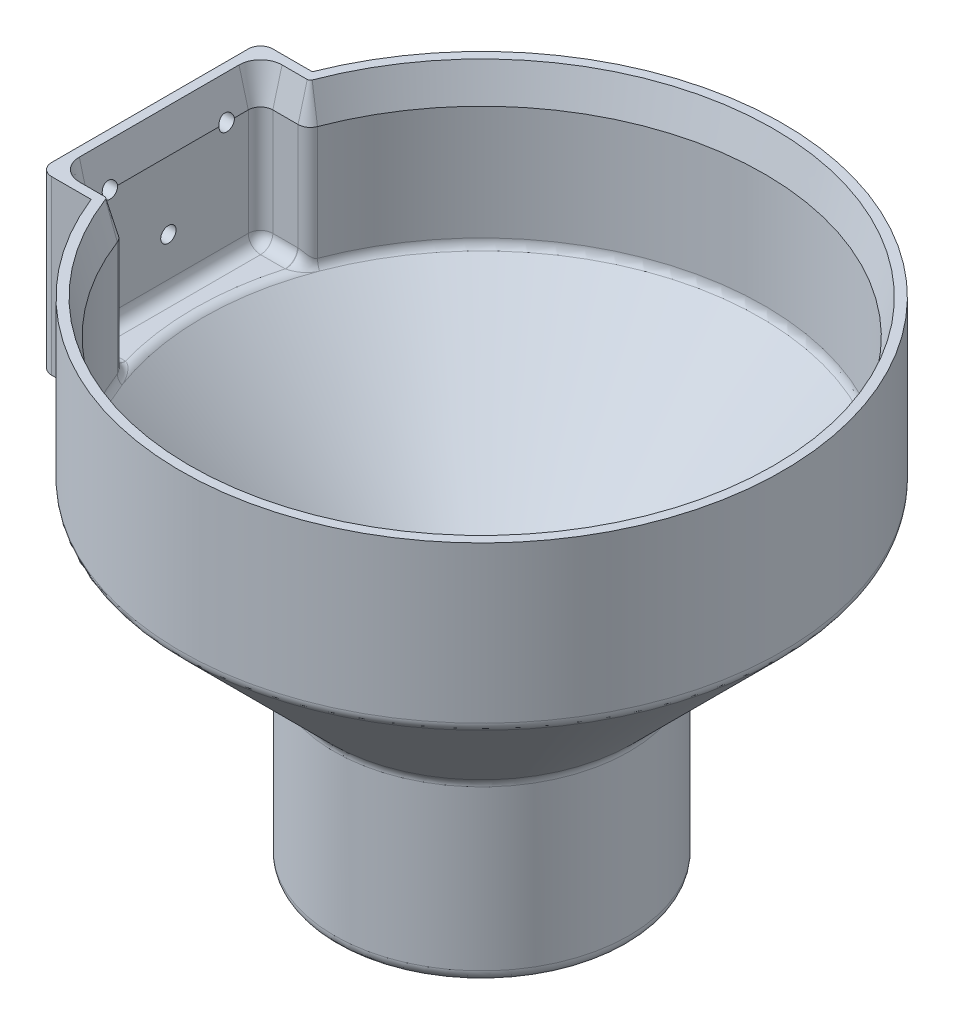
ISO-10303-21;
HEADER;
FILE_DESCRIPTION(('STEP AP214'),'2;1');
FILE_NAME('part.step','',(''),(''),'','','');
FILE_SCHEMA(('AUTOMOTIVE_DESIGN { 1 0 10303 214 1 1 1 1 }'));
ENDSEC;
DATA;
#1=APPLICATION_CONTEXT('core data for automotive mechanical design processes');
#2=APPLICATION_PROTOCOL_DEFINITION('international standard','automotive_design',2000,#1);
#3=PRODUCT_CONTEXT('',#1,'mechanical');
#4=PRODUCT('Part','Part','',(#3));
#5=PRODUCT_RELATED_PRODUCT_CATEGORY('part','',(#4));
#6=PRODUCT_DEFINITION_FORMATION('','',#4);
#7=PRODUCT_DEFINITION_CONTEXT('part definition',#1,'design');
#8=PRODUCT_DEFINITION('design','',#6,#7);
#9=PRODUCT_DEFINITION_SHAPE('','',#8);
#10=(LENGTH_UNIT() NAMED_UNIT(*) SI_UNIT(.MILLI.,.METRE.));
#11=(NAMED_UNIT(*) PLANE_ANGLE_UNIT() SI_UNIT($,.RADIAN.));
#12=(NAMED_UNIT(*) SI_UNIT($,.STERADIAN.) SOLID_ANGLE_UNIT());
#13=UNCERTAINTY_MEASURE_WITH_UNIT(LENGTH_MEASURE(1.E-05),#10,'distance_accuracy_value','');
#14=(GEOMETRIC_REPRESENTATION_CONTEXT(3) GLOBAL_UNCERTAINTY_ASSIGNED_CONTEXT((#13)) GLOBAL_UNIT_ASSIGNED_CONTEXT((#10,
#11,#12)) REPRESENTATION_CONTEXT('',''));
#15=CARTESIAN_POINT('',(0.,0.,0.));
#16=DIRECTION('',(0.,0.,1.));
#17=DIRECTION('',(1.,0.,0.));
#18=AXIS2_PLACEMENT_3D('',#15,#16,#17);
#19=CARTESIAN_POINT('',(0.,0.,0.));
#20=DIRECTION('',(0.,-1.,0.));
#21=DIRECTION('',(1.,0.,0.));
#22=AXIS2_PLACEMENT_3D('',#19,#20,#21);
#23=CYLINDRICAL_SURFACE('',#22,49.);
#24=DIRECTION('',(0.,-1.,0.));
#25=VECTOR('',#24,1.);
#26=CARTESIAN_POINT('',(-45.5741154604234,-1.56238318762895E-13,18.));
#27=LINE('',#26,#25);
#28=CARTESIAN_POINT('',(-45.5741154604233,-25.4142135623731,18.));
#29=VERTEX_POINT('',#28);
#30=CARTESIAN_POINT('',(-45.5741154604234,0.,18.));
#31=VERTEX_POINT('',#30);
#32=EDGE_CURVE('E799',#29,#31,#27,.F.);
#33=ORIENTED_EDGE('',*,*,#32,.F.);
#34=CARTESIAN_POINT('',(0.,-25.414213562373,0.));
#35=DIRECTION('',(0.,1.,0.));
#36=DIRECTION('',(-1.,0.,0.));
#37=AXIS2_PLACEMENT_3D('',#34,#35,#36);
#38=CIRCLE('',#37,49.);
#39=CARTESIAN_POINT('',(-45.5741154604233,-25.4142135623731,-18.));
#40=VERTEX_POINT('',#39);
#41=EDGE_CURVE('E684',#29,#40,#38,.T.);
#42=ORIENTED_EDGE('',*,*,#41,.T.);
#43=DIRECTION('',(0.,-1.,0.));
#44=VECTOR('',#43,1.);
#45=CARTESIAN_POINT('',(-45.5741154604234,-1.56238318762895E-13,-18.));
#46=LINE('',#45,#44);
#47=CARTESIAN_POINT('',(-45.5741154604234,0.,-18.));
#48=VERTEX_POINT('',#47);
#49=EDGE_CURVE('E704',#40,#48,#46,.F.);
#50=ORIENTED_EDGE('',*,*,#49,.T.);
#51=CARTESIAN_POINT('',(0.,0.,0.));
#52=DIRECTION('',(0.,-1.,0.));
#53=DIRECTION('',(1.,0.,0.));
#54=AXIS2_PLACEMENT_3D('',#51,#52,#53);
#55=CIRCLE('',#54,49.);
#56=EDGE_CURVE('E524',#48,#31,#55,.T.);
#57=ORIENTED_EDGE('',*,*,#56,.T.);
#58=EDGE_LOOP('',(#33,#42,#50,#57));
#59=FACE_BOUND('',#58,.T.);
#60=ADVANCED_FACE('F41',(#59),#23,.T.);
#61=CARTESIAN_POINT('',(0.,0.,0.));
#62=DIRECTION('',(0.,-1.,0.));
#63=DIRECTION('',(1.,0.,0.));
#64=AXIS2_PLACEMENT_3D('',#61,#62,#63);
#65=PLANE('',#64);
#66=CARTESIAN_POINT('',(-49.,0.,13.));
#67=DIRECTION('',(0.,-1.,0.));
#68=DIRECTION('',(1.,0.,0.));
#69=AXIS2_PLACEMENT_3D('',#66,#67,#68);
#70=CIRCLE('',#69,3.49999999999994);
#71=CARTESIAN_POINT('',(-49.,0.,16.4999999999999));
#72=VERTEX_POINT('',#71);
#73=CARTESIAN_POINT('',(-52.4999999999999,-1.03949323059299E-13,13.));
#74=VERTEX_POINT('',#73);
#75=EDGE_CURVE('E735',#72,#74,#70,.T.);
#76=ORIENTED_EDGE('',*,*,#75,.T.);
#77=DIRECTION('',(0.,0.,-1.));
#78=VECTOR('',#77,1.);
#79=CARTESIAN_POINT('',(-52.5,-1.03949323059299E-13,-13.));
#80=LINE('',#79,#78);
#81=CARTESIAN_POINT('',(-52.5,-1.03949323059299E-13,-13.));
#82=VERTEX_POINT('',#81);
#83=EDGE_CURVE('E242',#74,#82,#80,.T.);
#84=ORIENTED_EDGE('',*,*,#83,.T.);
#85=CARTESIAN_POINT('',(-49.,0.,-13.));
#86=DIRECTION('',(0.,-1.,0.));
#87=DIRECTION('',(1.,0.,0.));
#88=AXIS2_PLACEMENT_3D('',#85,#86,#87);
#89=CIRCLE('',#88,3.49999999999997);
#90=CARTESIAN_POINT('',(-49.,0.,-16.4999999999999));
#91=VERTEX_POINT('',#90);
#92=EDGE_CURVE('E736',#82,#91,#89,.T.);
#93=ORIENTED_EDGE('',*,*,#92,.T.);
#94=DIRECTION('',(1.,0.,0.));
#95=VECTOR('',#94,1.);
#96=CARTESIAN_POINT('',(0.,0.,-16.4999999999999));
#97=LINE('',#96,#95);
#98=CARTESIAN_POINT('',(-44.8887513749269,0.,-16.5));
#99=VERTEX_POINT('',#98);
#100=EDGE_CURVE('E733',#91,#99,#97,.T.);
#101=ORIENTED_EDGE('',*,*,#100,.T.);
#102=CARTESIAN_POINT('',(-44.8887513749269,0.,-17.));
#103=DIRECTION('',(0.,-1.,0.));
#104=DIRECTION('',(1.,0.,0.));
#105=AXIS2_PLACEMENT_3D('',#102,#103,#104);
#106=CIRCLE('',#105,0.500000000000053);
#107=CARTESIAN_POINT('',(-44.4211602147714,0.,-16.8229166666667));
#108=VERTEX_POINT('',#107);
#109=EDGE_CURVE('E729',#99,#108,#106,.F.);
#110=ORIENTED_EDGE('',*,*,#109,.T.);
#111=CARTESIAN_POINT('',(0.,0.,0.));
#112=DIRECTION('',(0.,-1.,0.));
#113=DIRECTION('',(1.,0.,0.));
#114=AXIS2_PLACEMENT_3D('',#111,#112,#113);
#115=CIRCLE('',#114,47.5);
#116=CARTESIAN_POINT('',(-44.4211602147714,0.,16.8229166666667));
#117=VERTEX_POINT('',#116);
#118=EDGE_CURVE('E725',#108,#117,#115,.T.);
#119=ORIENTED_EDGE('',*,*,#118,.T.);
#120=CARTESIAN_POINT('',(-44.8887513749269,0.,17.));
#121=DIRECTION('',(0.,-1.,0.));
#122=DIRECTION('',(1.,0.,0.));
#123=AXIS2_PLACEMENT_3D('',#120,#121,#122);
#124=CIRCLE('',#123,0.500000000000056);
#125=CARTESIAN_POINT('',(-44.8887513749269,0.,16.4999999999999));
#126=VERTEX_POINT('',#125);
#127=EDGE_CURVE('E727',#117,#126,#124,.F.);
#128=ORIENTED_EDGE('',*,*,#127,.T.);
#129=DIRECTION('',(-1.,0.,0.));
#130=VECTOR('',#129,1.);
#131=CARTESIAN_POINT('',(-49.,0.,16.4999999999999));
#132=LINE('',#131,#130);
#133=EDGE_CURVE('E731',#126,#72,#132,.T.);
#134=ORIENTED_EDGE('',*,*,#133,.T.);
#135=EDGE_LOOP('',(#76,#84,#93,#101,#110,#119,#128,#134));
#136=FACE_BOUND('',#135,.T.);
#137=DIRECTION('',(-1.,0.,0.));
#138=VECTOR('',#137,1.);
#139=CARTESIAN_POINT('',(0.,0.,-18.));
#140=LINE('',#139,#138);
#141=CARTESIAN_POINT('',(-52.,-1.02235210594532E-13,-18.));
#142=VERTEX_POINT('',#141);
#143=EDGE_CURVE('E520',#48,#142,#140,.T.);
#144=ORIENTED_EDGE('',*,*,#143,.T.);
#145=CARTESIAN_POINT('',(-52.,-1.00613961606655E-13,-16.));
#146=DIRECTION('',(0.,-1.,0.));
#147=DIRECTION('',(1.,0.,0.));
#148=AXIS2_PLACEMENT_3D('',#145,#146,#147);
#149=CIRCLE('',#148,2.);
#150=CARTESIAN_POINT('',(-54.,-1.07552855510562E-13,-16.));
#151=VERTEX_POINT('',#150);
#152=EDGE_CURVE('E679',#142,#151,#149,.F.);
#153=ORIENTED_EDGE('',*,*,#152,.T.);
#154=DIRECTION('',(0.,0.,-1.));
#155=VECTOR('',#154,1.);
#156=CARTESIAN_POINT('',(-54.,-1.07552855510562E-13,15.));
#157=LINE('',#156,#155);
#158=CARTESIAN_POINT('',(-54.,-1.07552855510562E-13,16.));
#159=VERTEX_POINT('',#158);
#160=EDGE_CURVE('E515',#159,#151,#157,.T.);
#161=ORIENTED_EDGE('',*,*,#160,.F.);
#162=CARTESIAN_POINT('',(-52.,-1.02235210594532E-13,16.));
#163=DIRECTION('',(0.,-1.,0.));
#164=DIRECTION('',(1.,0.,0.));
#165=AXIS2_PLACEMENT_3D('',#162,#163,#164);
#166=CIRCLE('',#165,2.);
#167=CARTESIAN_POINT('',(-52.,-1.02235210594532E-13,18.));
#168=VERTEX_POINT('',#167);
#169=EDGE_CURVE('E691',#159,#168,#166,.F.);
#170=ORIENTED_EDGE('',*,*,#169,.T.);
#171=DIRECTION('',(-1.,0.,0.));
#172=VECTOR('',#171,1.);
#173=CARTESIAN_POINT('',(0.,0.,18.));
#174=LINE('',#173,#172);
#175=EDGE_CURVE('E512',#31,#168,#174,.T.);
#176=ORIENTED_EDGE('',*,*,#175,.F.);
#177=ORIENTED_EDGE('',*,*,#56,.F.);
#178=EDGE_LOOP('',(#144,#153,#161,#170,#176,#177));
#179=FACE_BOUND('',#178,.T.);
#180=ADVANCED_FACE('F549',(#136,#179),#65,.F.);
#181=CARTESIAN_POINT('',(0.,-27.1213203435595,0.));
#182=DIRECTION('',(0.,1.,0.));
#183=DIRECTION('',(-1.,0.,0.));
#184=AXIS2_PLACEMENT_3D('',#181,#182,#183);
#185=CONICAL_SURFACE('',#184,48.1213203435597,0.785398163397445);
#186=CARTESIAN_POINT('',(1.73663090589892E-13,-50.6568542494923,0.));
#187=DIRECTION('',(0.,1.,0.));
#188=DIRECTION('',(-1.,0.,0.));
#189=AXIS2_PLACEMENT_3D('',#186,#187,#188);
#190=CIRCLE('',#189,24.5857864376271);
#191=CARTESIAN_POINT('',(-24.5857864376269,-50.6568542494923,0.));
#192=VERTEX_POINT('',#191);
#193=EDGE_CURVE('E794',#192,#192,#190,.T.);
#194=ORIENTED_EDGE('',*,*,#193,.T.);
#195=EDGE_LOOP('',(#194));
#196=FACE_BOUND('',#195,.T.);
#197=CARTESIAN_POINT('',(-45.5741154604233,-26.2426406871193,-18.));
#198=CARTESIAN_POINT('',(-45.2587198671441,-26.5360018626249,-18.));
#199=CARTESIAN_POINT('',(-44.9431072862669,-26.829129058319,-18.));
#200=CARTESIAN_POINT('',(-44.3114481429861,-27.4149154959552,-18.));
#201=CARTESIAN_POINT('',(-43.9954015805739,-27.7075747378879,-18.));
#202=CARTESIAN_POINT('',(-43.679138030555,-27.9999999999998,-18.));
#203=B_SPLINE_CURVE_WITH_KNOTS('',3,(#197,#198,#199,#200,#201,#202),.UNSPECIFIED.,.F.,.F.,(4,2,
4),(0.,1.29221270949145,2.58442544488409),.UNSPECIFIED.);
#204=CARTESIAN_POINT('',(-44.9436989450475,-26.8284271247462,-18.));
#205=VERTEX_POINT('',#204);
#206=CARTESIAN_POINT('',(-43.6791380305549,-27.9999999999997,-18.));
#207=VERTEX_POINT('',#206);
#208=EDGE_CURVE('E511',#205,#207,#203,.T.);
#209=ORIENTED_EDGE('',*,*,#208,.F.);
#210=CARTESIAN_POINT('',(0.,-26.8284271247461,0.));
#211=DIRECTION('',(0.,-1.,0.));
#212=DIRECTION('',(1.,0.,0.));
#213=AXIS2_PLACEMENT_3D('',#210,#211,#212);
#214=CIRCLE('',#213,48.4142135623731);
#215=CARTESIAN_POINT('',(-44.9436989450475,-26.8284271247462,18.));
#216=VERTEX_POINT('',#215);
#217=EDGE_CURVE('E791',#205,#216,#214,.T.);
#218=ORIENTED_EDGE('',*,*,#217,.T.);
#219=CARTESIAN_POINT('',(-45.5741154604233,-26.2426406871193,18.));
#220=CARTESIAN_POINT('',(-45.2587198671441,-26.5360018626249,18.));
#221=CARTESIAN_POINT('',(-44.9431072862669,-26.829129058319,18.));
#222=CARTESIAN_POINT('',(-44.3114481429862,-27.4149154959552,18.));
#223=CARTESIAN_POINT('',(-43.995401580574,-27.7075747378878,18.));
#224=CARTESIAN_POINT('',(-43.6791380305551,-27.9999999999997,18.));
#225=B_SPLINE_CURVE_WITH_KNOTS('',3,(#219,#220,#221,#222,#223,#224),.UNSPECIFIED.,.F.,.F.,(4,2,
4),(0.,1.29221270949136,2.58442544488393),.UNSPECIFIED.);
#226=CARTESIAN_POINT('',(-43.6791380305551,-27.9999999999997,18.));
#227=VERTEX_POINT('',#226);
#228=EDGE_CURVE('E527',#216,#227,#225,.T.);
#229=ORIENTED_EDGE('',*,*,#228,.T.);
#230=CARTESIAN_POINT('',(0.,-27.9999999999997,1.58946087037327E-13));
#231=DIRECTION('',(0.,1.,0.));
#232=DIRECTION('',(0.,0.,1.));
#233=AXIS2_PLACEMENT_3D('',#230,#231,#232);
#234=CIRCLE('',#233,47.2426406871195);
#235=EDGE_CURVE('E528',#227,#207,#234,.F.);
#236=ORIENTED_EDGE('',*,*,#235,.T.);
#237=EDGE_LOOP('',(#209,#218,#229,#236));
#238=FACE_BOUND('',#237,.T.);
#239=ADVANCED_FACE('F545',(#196,#238),#185,.T.);
#240=CARTESIAN_POINT('',(0.,0.,0.));
#241=DIRECTION('',(0.,-1.,0.));
#242=DIRECTION('',(1.,0.,0.));
#243=AXIS2_PLACEMENT_3D('',#240,#241,#242);
#244=CYLINDRICAL_SURFACE('',#243,24.0000000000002);
#245=CARTESIAN_POINT('',(2.6740154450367E-13,-78.,0.));
#246=DIRECTION('',(0.,1.,0.));
#247=DIRECTION('',(-1.,0.,0.));
#248=AXIS2_PLACEMENT_3D('',#245,#246,#247);
#249=CIRCLE('',#248,24.0000000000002);
#250=CARTESIAN_POINT('',(-24.,-78.0000000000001,0.));
#251=VERTEX_POINT('',#250);
#252=EDGE_CURVE('E788',#251,#251,#249,.T.);
#253=ORIENTED_EDGE('',*,*,#252,.T.);
#254=EDGE_LOOP('',(#253));
#255=FACE_BOUND('',#254,.T.);
#256=CARTESIAN_POINT('',(1.78511332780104E-13,-52.0710678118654,0.));
#257=DIRECTION('',(0.,-1.,0.));
#258=DIRECTION('',(1.,0.,0.));
#259=AXIS2_PLACEMENT_3D('',#256,#257,#258);
#260=CIRCLE('',#259,24.0000000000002);
#261=CARTESIAN_POINT('',(24.0000000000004,-52.0710678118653,0.));
#262=VERTEX_POINT('',#261);
#263=EDGE_CURVE('E785',#262,#262,#260,.T.);
#264=ORIENTED_EDGE('',*,*,#263,.T.);
#265=EDGE_LOOP('',(#264));
#266=FACE_BOUND('',#265,.T.);
#267=ADVANCED_FACE('F548',(#255,#266),#244,.T.);
#268=CARTESIAN_POINT('',(0.,0.,18.));
#269=DIRECTION('',(0.,0.,-1.));
#270=DIRECTION('',(-1.,0.,0.));
#271=AXIS2_PLACEMENT_3D('',#268,#269,#270);
#272=PLANE('',#271);
#273=ORIENTED_EDGE('',*,*,#175,.T.);
#274=DIRECTION('',(0.,-1.,0.));
#275=VECTOR('',#274,1.);
#276=CARTESIAN_POINT('',(-52.,0.,18.));
#277=LINE('',#276,#275);
#278=CARTESIAN_POINT('',(-52.,-27.9999999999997,18.));
#279=VERTEX_POINT('',#278);
#280=EDGE_CURVE('E565',#168,#279,#277,.T.);
#281=ORIENTED_EDGE('',*,*,#280,.T.);
#282=DIRECTION('',(1.,0.,0.));
#283=VECTOR('',#282,1.);
#284=CARTESIAN_POINT('',(0.,-27.9999999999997,18.));
#285=LINE('',#284,#283);
#286=EDGE_CURVE('E516',#279,#227,#285,.T.);
#287=ORIENTED_EDGE('',*,*,#286,.T.);
#288=ORIENTED_EDGE('',*,*,#228,.F.);
#289=CARTESIAN_POINT('',(-44.9436989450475,-26.8284271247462,18.));
#290=CARTESIAN_POINT('',(-44.984316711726,-26.7907192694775,18.));
#291=CARTESIAN_POINT('',(-45.0234120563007,-26.7514023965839,18.));
#292=CARTESIAN_POINT('',(-45.0982919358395,-26.6697121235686,18.));
#293=CARTESIAN_POINT('',(-45.134075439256,-26.6273377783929,18.));
#294=CARTESIAN_POINT('',(-45.2361298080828,-26.4957692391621,18.));
#295=CARTESIAN_POINT('',(-45.2969743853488,-26.4022497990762,18.));
#296=CARTESIAN_POINT('',(-45.4019111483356,-26.205999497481,18.));
#297=CARTESIAN_POINT('',(-45.4459633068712,-26.1032473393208,18.));
#298=CARTESIAN_POINT('',(-45.5152672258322,-25.8917876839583,18.));
#299=CARTESIAN_POINT('',(-45.5405711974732,-25.7830976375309,18.));
#300=CARTESIAN_POINT('',(-45.5620420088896,-25.6302599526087,18.));
#301=CARTESIAN_POINT('',(-45.5665674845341,-25.5871616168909,18.));
#302=CARTESIAN_POINT('',(-45.5726020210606,-25.5007872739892,18.));
#303=CARTESIAN_POINT('',(-45.5741133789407,-25.4575114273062,18.));
#304=CARTESIAN_POINT('',(-45.5741154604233,-25.4142135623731,18.));
#305=B_SPLINE_CURVE_WITH_KNOTS('',3,(#289,#290,#291,#292,#293,#294,#295,#296,#297,#298,#299,
#300,#301,#302,#303,#304),.UNSPECIFIED.,.F.,.F.,(4,2,2,2,2,2,2,4),(0.,0.16617847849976,
0.332408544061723,0.665393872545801,0.999168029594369,1.33200913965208,1.46193164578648,
1.59175510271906),.UNSPECIFIED.);
#306=EDGE_CURVE('E559',#216,#29,#305,.T.);
#307=ORIENTED_EDGE('',*,*,#306,.T.);
#308=ORIENTED_EDGE('',*,*,#32,.T.);
#309=EDGE_LOOP('',(#273,#281,#287,#288,#307,#308));
#310=FACE_BOUND('',#309,.T.);
#311=ADVANCED_FACE('F551',(#310),#272,.F.);
#312=CARTESIAN_POINT('',(0.,0.,-18.));
#313=DIRECTION('',(0.,0.,-1.));
#314=DIRECTION('',(-1.,0.,0.));
#315=AXIS2_PLACEMENT_3D('',#312,#313,#314);
#316=PLANE('',#315);
#317=DIRECTION('',(1.,0.,0.));
#318=VECTOR('',#317,1.);
#319=CARTESIAN_POINT('',(0.,-27.9999999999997,-18.));
#320=LINE('',#319,#318);
#321=CARTESIAN_POINT('',(-52.,-27.9999999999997,-18.));
#322=VERTEX_POINT('',#321);
#323=EDGE_CURVE('E523',#322,#207,#320,.T.);
#324=ORIENTED_EDGE('',*,*,#323,.F.);
#325=DIRECTION('',(0.,-1.,0.));
#326=VECTOR('',#325,1.);
#327=CARTESIAN_POINT('',(-52.,-1.07552855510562E-13,-18.));
#328=LINE('',#327,#326);
#329=EDGE_CURVE('E689',#322,#142,#328,.F.);
#330=ORIENTED_EDGE('',*,*,#329,.T.);
#331=ORIENTED_EDGE('',*,*,#143,.F.);
#332=ORIENTED_EDGE('',*,*,#49,.F.);
#333=CARTESIAN_POINT('',(-45.5741154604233,-25.4142135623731,-18.));
#334=CARTESIAN_POINT('',(-45.5741232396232,-25.4675857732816,-18.));
#335=CARTESIAN_POINT('',(-45.5718185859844,-25.5209543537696,-18.));
#336=CARTESIAN_POINT('',(-45.5626437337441,-25.6272893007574,-18.));
#337=CARTESIAN_POINT('',(-45.5557742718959,-25.6802557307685,-18.));
#338=CARTESIAN_POINT('',(-45.5375493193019,-25.7852923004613,-18.));
#339=CARTESIAN_POINT('',(-45.5262038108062,-25.8373641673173,-18.));
#340=CARTESIAN_POINT('',(-45.4991506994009,-25.9403474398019,-18.));
#341=CARTESIAN_POINT('',(-45.4834431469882,-25.9912588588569,-18.));
#342=CARTESIAN_POINT('',(-45.4299886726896,-26.141717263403,-18.));
#343=CARTESIAN_POINT('',(-45.3858934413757,-26.2390820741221,-18.));
#344=CARTESIAN_POINT('',(-45.2824296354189,-26.4252296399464,-18.));
#345=CARTESIAN_POINT('',(-45.223067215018,-26.5140158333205,-18.));
#346=CARTESIAN_POINT('',(-45.1245661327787,-26.6387092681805,-18.));
#347=CARTESIAN_POINT('',(-45.0903984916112,-26.6786358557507,-18.));
#348=CARTESIAN_POINT('',(-45.0191696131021,-26.755660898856,-18.));
#349=CARTESIAN_POINT('',(-44.9821147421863,-26.7927652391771,-18.));
#350=CARTESIAN_POINT('',(-44.9436989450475,-26.8284271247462,-18.));
#351=B_SPLINE_CURVE_WITH_KNOTS('',3,(#333,#334,#335,#336,#337,#338,#339,#340,#341,#342,#343,
#344,#345,#346,#347,#348,#349,#350),.UNSPECIFIED.,.F.,.F.,(4,2,2,2,2,2,2,2,4),(0.,
0.160060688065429,0.320095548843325,0.479775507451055,0.639453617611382,0.958528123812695,
1.27747421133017,1.43499096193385,1.59216971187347),.UNSPECIFIED.);
#352=EDGE_CURVE('E301',#40,#205,#351,.T.);
#353=ORIENTED_EDGE('',*,*,#352,.T.);
#354=ORIENTED_EDGE('',*,*,#208,.T.);
#355=EDGE_LOOP('',(#324,#330,#331,#332,#353,#354));
#356=FACE_BOUND('',#355,.T.);
#357=ADVANCED_FACE('F542',(#356),#316,.T.);
#358=CARTESIAN_POINT('',(-54.,-24.9999999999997,15.));
#359=DIRECTION('',(1.,0.,0.));
#360=DIRECTION('',(0.,0.,-1.));
#361=AXIS2_PLACEMENT_3D('',#358,#359,#360);
#362=PLANE('',#361);
#363=CARTESIAN_POINT('',(-54.,-16.6419511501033,0.));
#364=DIRECTION('',(-1.,0.,0.));
#365=DIRECTION('',(0.,0.,1.));
#366=AXIS2_PLACEMENT_3D('',#363,#364,#365);
#367=CIRCLE('',#366,1.25);
#368=CARTESIAN_POINT('',(-54.,-16.6419511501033,1.25));
#369=VERTEX_POINT('',#368);
#370=EDGE_CURVE('E259',#369,#369,#367,.T.);
#371=ORIENTED_EDGE('',*,*,#370,.F.);
#372=EDGE_LOOP('',(#371));
#373=FACE_BOUND('',#372,.T.);
#374=CARTESIAN_POINT('',(-54.,-5.68750000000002,-9.5));
#375=DIRECTION('',(-1.,0.,0.));
#376=DIRECTION('',(0.,0.,1.));
#377=AXIS2_PLACEMENT_3D('',#374,#375,#376);
#378=CIRCLE('',#377,1.25);
#379=CARTESIAN_POINT('',(-54.,-5.68750000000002,-8.25));
#380=VERTEX_POINT('',#379);
#381=EDGE_CURVE('E226',#380,#380,#378,.T.);
#382=ORIENTED_EDGE('',*,*,#381,.F.);
#383=EDGE_LOOP('',(#382));
#384=FACE_BOUND('',#383,.T.);
#385=CARTESIAN_POINT('',(-54.,-5.68750000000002,9.5));
#386=DIRECTION('',(-1.,0.,0.));
#387=DIRECTION('',(0.,0.,1.));
#388=AXIS2_PLACEMENT_3D('',#385,#386,#387);
#389=CIRCLE('',#388,1.25);
#390=CARTESIAN_POINT('',(-54.,-5.68750000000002,10.75));
#391=VERTEX_POINT('',#390);
#392=EDGE_CURVE('E234',#391,#391,#389,.T.);
#393=ORIENTED_EDGE('',*,*,#392,.F.);
#394=EDGE_LOOP('',(#393));
#395=FACE_BOUND('',#394,.T.);
#396=ORIENTED_EDGE('',*,*,#160,.T.);
#397=DIRECTION('',(0.,-1.,0.));
#398=VECTOR('',#397,1.);
#399=CARTESIAN_POINT('',(-54.,-27.9999999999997,-16.));
#400=LINE('',#399,#398);
#401=CARTESIAN_POINT('',(-54.,-27.9999999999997,-16.));
#402=VERTEX_POINT('',#401);
#403=EDGE_CURVE('E671',#151,#402,#400,.T.);
#404=ORIENTED_EDGE('',*,*,#403,.T.);
#405=DIRECTION('',(0.,0.,-1.));
#406=VECTOR('',#405,1.);
#407=CARTESIAN_POINT('',(-54.,-27.9999999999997,15.));
#408=LINE('',#407,#406);
#409=CARTESIAN_POINT('',(-54.,-27.9999999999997,16.));
#410=VERTEX_POINT('',#409);
#411=EDGE_CURVE('E519',#410,#402,#408,.T.);
#412=ORIENTED_EDGE('',*,*,#411,.F.);
#413=DIRECTION('',(0.,-1.,0.));
#414=VECTOR('',#413,1.);
#415=CARTESIAN_POINT('',(-54.,-24.9999999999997,16.));
#416=LINE('',#415,#414);
#417=EDGE_CURVE('E674',#410,#159,#416,.F.);
#418=ORIENTED_EDGE('',*,*,#417,.T.);
#419=EDGE_LOOP('',(#396,#404,#412,#418));
#420=FACE_BOUND('',#419,.T.);
#421=ADVANCED_FACE('F648',(#373,#384,#395,#420),#362,.F.);
#422=CARTESIAN_POINT('',(-51.,-27.9999999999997,15.));
#423=DIRECTION('',(0.,1.,0.));
#424=DIRECTION('',(0.,0.,1.));
#425=AXIS2_PLACEMENT_3D('',#422,#423,#424);
#426=PLANE('',#425);
#427=ORIENTED_EDGE('',*,*,#411,.T.);
#428=CARTESIAN_POINT('',(-52.,-27.9999999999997,-16.));
#429=DIRECTION('',(0.,1.,0.));
#430=DIRECTION('',(0.,0.,1.));
#431=AXIS2_PLACEMENT_3D('',#428,#429,#430);
#432=CIRCLE('',#431,2.);
#433=EDGE_CURVE('E680',#402,#322,#432,.F.);
#434=ORIENTED_EDGE('',*,*,#433,.T.);
#435=ORIENTED_EDGE('',*,*,#323,.T.);
#436=ORIENTED_EDGE('',*,*,#235,.F.);
#437=ORIENTED_EDGE('',*,*,#286,.F.);
#438=CARTESIAN_POINT('',(-52.,-27.9999999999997,16.));
#439=DIRECTION('',(0.,1.,0.));
#440=DIRECTION('',(0.,0.,1.));
#441=AXIS2_PLACEMENT_3D('',#438,#439,#440);
#442=CIRCLE('',#441,2.);
#443=EDGE_CURVE('E681',#279,#410,#442,.F.);
#444=ORIENTED_EDGE('',*,*,#443,.T.);
#445=EDGE_LOOP('',(#427,#434,#435,#436,#437,#444));
#446=FACE_BOUND('',#445,.T.);
#447=ADVANCED_FACE('F442',(#446),#426,.F.);
#448=CARTESIAN_POINT('',(0.,0.,0.));
#449=DIRECTION('',(0.,-1.,0.));
#450=DIRECTION('',(1.,0.,0.));
#451=AXIS2_PLACEMENT_3D('',#448,#449,#450);
#452=CYLINDRICAL_SURFACE('',#451,46.);
#453=DIRECTION('',(0.,-1.,0.));
#454=VECTOR('',#453,1.);
#455=CARTESIAN_POINT('',(-43.018386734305,-1.47476705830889E-13,16.2916666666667));
#456=LINE('',#455,#454);
#457=CARTESIAN_POINT('',(-43.0183867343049,-24.1715728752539,16.2916666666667));
#458=VERTEX_POINT('',#457);
#459=CARTESIAN_POINT('',(-43.018386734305,-5.59807621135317,16.2916666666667));
#460=VERTEX_POINT('',#459);
#461=EDGE_CURVE('E779',#458,#460,#456,.F.);
#462=ORIENTED_EDGE('',*,*,#461,.T.);
#463=CARTESIAN_POINT('',(0.,-5.59807621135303,0.));
#464=DIRECTION('',(0.,-1.,0.));
#465=DIRECTION('',(1.,0.,0.));
#466=AXIS2_PLACEMENT_3D('',#463,#464,#465);
#467=CIRCLE('',#466,46.);
#468=CARTESIAN_POINT('',(-43.018386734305,-5.59807621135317,-16.2916666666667));
#469=VERTEX_POINT('',#468);
#470=EDGE_CURVE('E11',#460,#469,#467,.F.);
#471=ORIENTED_EDGE('',*,*,#470,.T.);
#472=DIRECTION('',(0.,-1.,0.));
#473=VECTOR('',#472,1.);
#474=CARTESIAN_POINT('',(-43.018386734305,-1.47476705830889E-13,-16.2916666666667));
#475=LINE('',#474,#473);
#476=CARTESIAN_POINT('',(-43.0183867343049,-24.1715728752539,-16.2916666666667));
#477=VERTEX_POINT('',#476);
#478=EDGE_CURVE('E757',#469,#477,#475,.T.);
#479=ORIENTED_EDGE('',*,*,#478,.T.);
#480=CARTESIAN_POINT('',(0.,-24.1715728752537,0.));
#481=DIRECTION('',(0.,-1.,0.));
#482=DIRECTION('',(1.,0.,0.));
#483=AXIS2_PLACEMENT_3D('',#480,#481,#482);
#484=CIRCLE('',#483,46.);
#485=EDGE_CURVE('E777',#477,#458,#484,.T.);
#486=ORIENTED_EDGE('',*,*,#485,.T.);
#487=EDGE_LOOP('',(#462,#471,#479,#486));
#488=FACE_BOUND('',#487,.T.);
#489=ADVANCED_FACE('F655',(#488),#452,.F.);
#490=CARTESIAN_POINT('',(0.,-24.9999999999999,0.));
#491=DIRECTION('',(0.,1.,0.));
#492=DIRECTION('',(-1.,0.,0.));
#493=AXIS2_PLACEMENT_3D('',#490,#491,#492);
#494=CONICAL_SURFACE('',#493,46.0000000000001,0.785398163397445);
#495=CARTESIAN_POINT('',(0.,-25.5857864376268,0.));
#496=DIRECTION('',(0.,1.,0.));
#497=DIRECTION('',(-1.,0.,0.));
#498=AXIS2_PLACEMENT_3D('',#495,#496,#497);
#499=CIRCLE('',#498,45.4142135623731);
#500=CARTESIAN_POINT('',(-42.4705696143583,-25.585786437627,16.0842006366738));
#501=VERTEX_POINT('',#500);
#502=CARTESIAN_POINT('',(-42.4705696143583,-25.585786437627,-16.0842006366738));
#503=VERTEX_POINT('',#502);
#504=EDGE_CURVE('E488',#501,#503,#499,.T.);
#505=ORIENTED_EDGE('',*,*,#504,.T.);
#506=CARTESIAN_POINT('',(0.,-25.5857864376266,0.));
#507=DIRECTION('',(0.,-1.,0.));
#508=DIRECTION('',(0.,0.,-1.));
#509=AXIS2_PLACEMENT_3D('',#506,#507,#508);
#510=CIRCLE('',#509,45.4142135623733);
#511=EDGE_CURVE('E493',#503,#501,#510,.F.);
#512=ORIENTED_EDGE('',*,*,#511,.T.);
#513=EDGE_LOOP('',(#505,#512));
#514=FACE_BOUND('',#513,.T.);
#515=CARTESIAN_POINT('',(1.69403038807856E-13,-49.414213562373,0.));
#516=DIRECTION('',(0.,-1.,0.));
#517=DIRECTION('',(1.,0.,0.));
#518=AXIS2_PLACEMENT_3D('',#515,#516,#517);
#519=CIRCLE('',#518,21.5857864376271);
#520=CARTESIAN_POINT('',(21.5857864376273,-49.4142135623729,0.));
#521=VERTEX_POINT('',#520);
#522=EDGE_CURVE('E494',#521,#521,#519,.T.);
#523=ORIENTED_EDGE('',*,*,#522,.T.);
#524=EDGE_LOOP('',(#523));
#525=FACE_BOUND('',#524,.T.);
#526=ADVANCED_FACE('F496',(#514,#525),#494,.F.);
#527=CARTESIAN_POINT('',(0.,0.,0.));
#528=DIRECTION('',(0.,-1.,0.));
#529=DIRECTION('',(1.,0.,0.));
#530=AXIS2_PLACEMENT_3D('',#527,#528,#529);
#531=CYLINDRICAL_SURFACE('',#530,21.0000000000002);
#532=CARTESIAN_POINT('',(2.42272220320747E-13,-70.6698729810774,0.));
#533=DIRECTION('',(0.,1.,0.));
#534=DIRECTION('',(-1.,0.,0.));
#535=AXIS2_PLACEMENT_3D('',#532,#533,#534);
#536=CIRCLE('',#535,21.0000000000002);
#537=CARTESIAN_POINT('',(-21.,-70.6698729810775,0.));
#538=VERTEX_POINT('',#537);
#539=EDGE_CURVE('E719',#538,#538,#536,.F.);
#540=ORIENTED_EDGE('',*,*,#539,.T.);
#541=EDGE_LOOP('',(#540));
#542=FACE_BOUND('',#541,.T.);
#543=CARTESIAN_POINT('',(1.74251280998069E-13,-50.8284271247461,0.));
#544=DIRECTION('',(0.,1.,0.));
#545=DIRECTION('',(-1.,0.,0.));
#546=AXIS2_PLACEMENT_3D('',#543,#544,#545);
#547=CIRCLE('',#546,21.0000000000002);
#548=CARTESIAN_POINT('',(-21.,-50.8284271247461,0.));
#549=VERTEX_POINT('',#548);
#550=EDGE_CURVE('E782',#549,#549,#547,.T.);
#551=ORIENTED_EDGE('',*,*,#550,.T.);
#552=EDGE_LOOP('',(#551));
#553=FACE_BOUND('',#552,.T.);
#554=ADVANCED_FACE('F420',(#542,#553),#531,.F.);
#555=CARTESIAN_POINT('',(0.,0.,15.));
#556=DIRECTION('',(0.,0.,-1.));
#557=DIRECTION('',(-1.,0.,0.));
#558=AXIS2_PLACEMENT_3D('',#555,#556,#557);
#559=PLANE('',#558);
#560=DIRECTION('',(0.,-1.,0.));
#561=VECTOR('',#560,1.);
#562=CARTESIAN_POINT('',(-49.,0.,15.));
#563=LINE('',#562,#561);
#564=CARTESIAN_POINT('',(-49.,-22.9999999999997,15.));
#565=VERTEX_POINT('',#564);
#566=CARTESIAN_POINT('',(-49.,-5.59807621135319,15.));
#567=VERTEX_POINT('',#566);
#568=EDGE_CURVE('E498',#565,#567,#563,.F.);
#569=ORIENTED_EDGE('',*,*,#568,.T.);
#570=DIRECTION('',(1.,0.,0.));
#571=VECTOR('',#570,1.);
#572=CARTESIAN_POINT('',(-44.8887513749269,-5.59807621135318,15.));
#573=LINE('',#572,#571);
#574=CARTESIAN_POINT('',(-44.8887513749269,-5.59807621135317,15.));
#575=VERTEX_POINT('',#574);
#576=EDGE_CURVE('E251',#567,#575,#573,.T.);
#577=ORIENTED_EDGE('',*,*,#576,.T.);
#578=DIRECTION('',(0.,-1.,0.));
#579=VECTOR('',#578,1.);
#580=CARTESIAN_POINT('',(-44.8887513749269,-1.53888736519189E-13,15.));
#581=LINE('',#580,#579);
#582=CARTESIAN_POINT('',(-44.8887513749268,-23.00113164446,15.));
#583=VERTEX_POINT('',#582);
#584=EDGE_CURVE('E436',#575,#583,#581,.T.);
#585=ORIENTED_EDGE('',*,*,#584,.T.);
#586=CARTESIAN_POINT('',(-45.760130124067,-25.1234656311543,12.8134555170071));
#587=CARTESIAN_POINT('',(-45.6916004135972,-25.3164988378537,15.));
#588=CARTESIAN_POINT('',(-46.4263282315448,-23.2469312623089,15.));
#589=CARTESIAN_POINT('',(-45.6975764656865,-25.1027226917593,12.8281906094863));
#590=CARTESIAN_POINT('',(-45.6408236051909,-25.2812229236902,15.));
#591=CARTESIAN_POINT('',(-46.309472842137,-23.2054453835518,15.));
#592=CARTESIAN_POINT('',(-45.6340369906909,-25.0845489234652,12.8432479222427));
#593=CARTESIAN_POINT('',(-45.5874524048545,-25.2475700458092,15.));
#594=CARTESIAN_POINT('',(-46.1908577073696,-23.1690978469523,15.));
#595=CARTESIAN_POINT('',(-45.5054249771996,-25.053414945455,12.8739184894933));
#596=CARTESIAN_POINT('',(-45.4762021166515,-25.1845104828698,15.));
#597=CARTESIAN_POINT('',(-45.9509425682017,-23.1068298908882,15.));
#598=CARTESIAN_POINT('',(-45.4403527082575,-25.0404538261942,12.8895316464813));
#599=CARTESIAN_POINT('',(-45.4183718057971,-25.1550746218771,15.));
#600=CARTESIAN_POINT('',(-45.8296430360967,-23.0809076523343,15.));
#601=CARTESIAN_POINT('',(-45.2472186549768,-25.0100835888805,12.9361726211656));
#602=CARTESIAN_POINT('',(-45.2427262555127,-25.0759069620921,15.));
#603=CARTESIAN_POINT('',(-45.4699062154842,-23.0201671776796,15.));
#604=CARTESIAN_POINT('',(-45.117607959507,-25.0000005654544,12.967856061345));
#605=CARTESIAN_POINT('',(-45.1186580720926,-25.0323994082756,15.));
#606=CARTESIAN_POINT('',(-45.228845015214,-23.0000011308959,15.));
#607=CARTESIAN_POINT('',(-44.858935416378,-24.9999994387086,13.0319072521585));
#608=CARTESIAN_POINT('',(-44.8599566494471,-24.9683500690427,15.));
#609=CARTESIAN_POINT('',(-44.7485174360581,-22.9999988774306,15.));
#610=CARTESIAN_POINT('',(-44.7298765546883,-25.0099334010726,13.0642682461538));
#611=CARTESIAN_POINT('',(-44.7256104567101,-24.9472944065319,15.));
#612=CARTESIAN_POINT('',(-44.5092509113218,-23.0198668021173,15.));
#613=CARTESIAN_POINT('',(-44.5369080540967,-25.0397492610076,13.1132601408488));
#614=CARTESIAN_POINT('',(-44.5169666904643,-24.9345118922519,15.));
#615=CARTESIAN_POINT('',(-44.1520846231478,-23.0794985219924,15.));
#616=CARTESIAN_POINT('',(-44.4717812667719,-25.0524624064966,13.1299021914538));
#617=CARTESIAN_POINT('',(-44.4455828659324,-24.933456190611,15.));
#618=CARTESIAN_POINT('',(-44.0316446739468,-23.1049248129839,15.));
#619=CARTESIAN_POINT('',(-44.3428193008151,-25.0829728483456,13.163062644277));
#620=CARTESIAN_POINT('',(-44.3020387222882,-24.9382310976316,15.));
#621=CARTESIAN_POINT('',(-43.79335449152,-23.1659456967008,15.));
#622=CARTESIAN_POINT('',(-44.2789842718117,-25.1007707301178,13.179581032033));
#623=CARTESIAN_POINT('',(-44.229873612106,-24.9440100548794,15.));
#624=CARTESIAN_POINT('',(-43.6755045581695,-23.2015414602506,15.));
#625=CARTESIAN_POINT('',(-44.2160100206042,-25.1210690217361,13.1959778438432));
#626=CARTESIAN_POINT('',(-44.1574064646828,-24.9533857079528,15.));
#627=CARTESIAN_POINT('',(-43.55934339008,-23.2421380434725,15.));
#628=(BOUNDED_SURFACE() B_SPLINE_SURFACE(3,2,((#586,#587,#588),(#589,#590,#591),(#592,#593,
#594),(#595,#596,#597),(#598,#599,#600),(#601,#602,#603),(#604,#605,#606),(#607,#608,#609),
(#610,#611,#612),(#613,#614,#615),(#616,#617,#618),(#619,#620,#621),(#622,#623,#624),(#625,#626,
#627)),.UNSPECIFIED.,.F.,.F.,.F.) B_SPLINE_SURFACE_WITH_KNOTS((4,2,2,2,2,2,4),(3,3),(0.,
0.371767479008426,0.743470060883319,1.46559327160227,2.18239924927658,2.55128765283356,
2.92021854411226),(0.,1.),
.UNSPECIFIED.) GEOMETRIC_REPRESENTATION_ITEM() RATIONAL_B_SPLINE_SURFACE(((1.,0.673323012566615,
1.),(1.,0.676058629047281,1.),(1.,0.678837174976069,1.),(1.,0.684461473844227,1.),(1.,
0.687307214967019,1.),(1.,0.695754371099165,1.),(1.,0.701424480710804,1.),(1.,0.712747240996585,
1.),(1.,0.718399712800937,1.),(1.,0.726858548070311,1.),(1.,0.729714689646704,1.),(1.,
0.735373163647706,1.),(1.,0.73817548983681,1.),(1.,0.740941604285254,1.))) REPRESENTATION_ITEM('') SURFACE());
#629=CARTESIAN_POINT('',(-43.55934339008,-23.2421380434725,15.));
#630=CARTESIAN_POINT('',(-43.6755045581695,-23.2015414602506,15.));
#631=CARTESIAN_POINT('',(-43.79335449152,-23.1659456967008,15.));
#632=CARTESIAN_POINT('',(-44.0316446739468,-23.1049248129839,15.));
#633=CARTESIAN_POINT('',(-44.1520846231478,-23.0794985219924,15.));
#634=CARTESIAN_POINT('',(-44.5092509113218,-23.0198668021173,15.));
#635=CARTESIAN_POINT('',(-44.7485174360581,-22.9999988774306,15.));
#636=CARTESIAN_POINT('',(-45.228845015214,-23.0000011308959,15.));
#637=CARTESIAN_POINT('',(-45.4699062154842,-23.0201671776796,15.));
#638=CARTESIAN_POINT('',(-45.8296430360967,-23.0809076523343,15.));
#639=CARTESIAN_POINT('',(-45.9509425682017,-23.1068298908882,15.));
#640=CARTESIAN_POINT('',(-46.1908577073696,-23.1690978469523,15.));
#641=CARTESIAN_POINT('',(-46.309472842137,-23.2054453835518,15.));
#642=CARTESIAN_POINT('',(-46.4263282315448,-23.2469312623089,15.));
#643=B_SPLINE_CURVE_WITH_KNOTS('',3,(#629,#630,#631,#632,#633,#634,#635,#636,#637,#638,#639,
#640,#641,#642),.UNSPECIFIED.,.F.,.F.,(4,2,2,2,2,2,4),(0.,0.368930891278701,0.737819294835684,
1.45462527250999,2.17674848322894,2.54845106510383,2.92021854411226),.UNSPECIFIED.);
#644=CARTESIAN_POINT('',(-44.9877937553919,-22.9999999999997,15.));
#645=VERTEX_POINT('',#644);
#646=EDGE_CURVE('E428',#583,#645,#643,.T.);
#647=ORIENTED_EDGE('',*,*,#646,.T.);
#648=DIRECTION('',(1.,0.,0.));
#649=VECTOR('',#648,1.);
#650=CARTESIAN_POINT('',(-51.,-22.9999999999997,15.));
#651=LINE('',#650,#649);
#652=EDGE_CURVE('E437',#645,#565,#651,.F.);
#653=ORIENTED_EDGE('',*,*,#652,.T.);
#654=EDGE_LOOP('',(#569,#577,#585,#647,#653));
#655=FACE_BOUND('',#654,.T.);
#656=ADVANCED_FACE('F414',(#655),#559,.T.);
#657=CARTESIAN_POINT('',(0.,0.,-15.));
#658=DIRECTION('',(0.,0.,-1.));
#659=DIRECTION('',(-1.,0.,0.));
#660=AXIS2_PLACEMENT_3D('',#657,#658,#659);
#661=PLANE('',#660);
#662=DIRECTION('',(0.,1.,0.));
#663=VECTOR('',#662,1.);
#664=CARTESIAN_POINT('',(-44.8887513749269,0.,-15.));
#665=LINE('',#664,#663);
#666=CARTESIAN_POINT('',(-44.8887513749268,-23.00113164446,-15.));
#667=VERTEX_POINT('',#666);
#668=CARTESIAN_POINT('',(-44.8887513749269,-5.59807621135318,-15.));
#669=VERTEX_POINT('',#668);
#670=EDGE_CURVE('E755',#667,#669,#665,.T.);
#671=ORIENTED_EDGE('',*,*,#670,.T.);
#672=DIRECTION('',(-1.,0.,0.));
#673=VECTOR('',#672,1.);
#674=CARTESIAN_POINT('',(0.,-5.59807621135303,-15.));
#675=LINE('',#674,#673);
#676=CARTESIAN_POINT('',(-49.,-5.59807621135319,-15.));
#677=VERTEX_POINT('',#676);
#678=EDGE_CURVE('E249',#669,#677,#675,.T.);
#679=ORIENTED_EDGE('',*,*,#678,.T.);
#680=DIRECTION('',(0.,-1.,0.));
#681=VECTOR('',#680,1.);
#682=CARTESIAN_POINT('',(-49.,0.,-15.));
#683=LINE('',#682,#681);
#684=CARTESIAN_POINT('',(-49.,-22.9999999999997,-15.));
#685=VERTEX_POINT('',#684);
#686=EDGE_CURVE('E774',#677,#685,#683,.T.);
#687=ORIENTED_EDGE('',*,*,#686,.T.);
#688=DIRECTION('',(1.,0.,0.));
#689=VECTOR('',#688,1.);
#690=CARTESIAN_POINT('',(0.,-22.9999999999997,-15.));
#691=LINE('',#690,#689);
#692=CARTESIAN_POINT('',(-44.9877937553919,-22.9999999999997,-15.));
#693=VERTEX_POINT('',#692);
#694=EDGE_CURVE('E764',#685,#693,#691,.T.);
#695=ORIENTED_EDGE('',*,*,#694,.T.);
#696=CARTESIAN_POINT('',(-46.4263282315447,-23.2469312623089,-15.));
#697=CARTESIAN_POINT('',(-45.6916004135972,-25.3164988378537,-15.));
#698=CARTESIAN_POINT('',(-45.7601301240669,-25.1234656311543,-12.8134555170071));
#699=CARTESIAN_POINT('',(-46.3094728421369,-23.2054453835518,-15.));
#700=CARTESIAN_POINT('',(-45.6408236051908,-25.2812229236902,-15.));
#701=CARTESIAN_POINT('',(-45.6975764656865,-25.1027226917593,-12.8281906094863));
#702=CARTESIAN_POINT('',(-46.1908577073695,-23.1690978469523,-15.));
#703=CARTESIAN_POINT('',(-45.5874524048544,-25.2475700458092,-15.));
#704=CARTESIAN_POINT('',(-45.6340369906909,-25.0845489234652,-12.8432479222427));
#705=CARTESIAN_POINT('',(-45.9509425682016,-23.1068298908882,-15.));
#706=CARTESIAN_POINT('',(-45.4762021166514,-25.1845104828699,-15.));
#707=CARTESIAN_POINT('',(-45.5054249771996,-25.053414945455,-12.8739184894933));
#708=CARTESIAN_POINT('',(-45.8296430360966,-23.0809076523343,-15.));
#709=CARTESIAN_POINT('',(-45.418371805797,-25.1550746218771,-15.));
#710=CARTESIAN_POINT('',(-45.4403527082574,-25.0404538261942,-12.8895316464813));
#711=CARTESIAN_POINT('',(-45.4699062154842,-23.0201671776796,-15.));
#712=CARTESIAN_POINT('',(-45.2427262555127,-25.0759069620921,-15.));
#713=CARTESIAN_POINT('',(-45.2472186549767,-25.0100835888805,-12.9361726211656));
#714=CARTESIAN_POINT('',(-45.2288450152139,-23.0000011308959,-15.));
#715=CARTESIAN_POINT('',(-45.1186580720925,-25.0323994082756,-15.));
#716=CARTESIAN_POINT('',(-45.1176079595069,-25.0000005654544,-12.967856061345));
#717=CARTESIAN_POINT('',(-44.748517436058,-22.9999988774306,-15.));
#718=CARTESIAN_POINT('',(-44.859956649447,-24.9683500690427,-15.));
#719=CARTESIAN_POINT('',(-44.8589354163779,-24.9999994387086,-13.0319072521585));
#720=CARTESIAN_POINT('',(-44.5092509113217,-23.0198668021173,-15.));
#721=CARTESIAN_POINT('',(-44.72561045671,-24.9472944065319,-15.));
#722=CARTESIAN_POINT('',(-44.7298765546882,-25.0099334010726,-13.0642682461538));
#723=CARTESIAN_POINT('',(-44.1520846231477,-23.0794985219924,-15.));
#724=CARTESIAN_POINT('',(-44.5169666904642,-24.9345118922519,-15.));
#725=CARTESIAN_POINT('',(-44.5369080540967,-25.0397492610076,-13.1132601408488));
#726=CARTESIAN_POINT('',(-44.0316446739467,-23.1049248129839,-15.));
#727=CARTESIAN_POINT('',(-44.4455828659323,-24.933456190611,-15.));
#728=CARTESIAN_POINT('',(-44.4717812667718,-25.0524624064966,-13.1299021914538));
#729=CARTESIAN_POINT('',(-43.79335449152,-23.1659456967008,-15.));
#730=CARTESIAN_POINT('',(-44.3020387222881,-24.9382310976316,-15.));
#731=CARTESIAN_POINT('',(-44.342819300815,-25.0829728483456,-13.163062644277));
#732=CARTESIAN_POINT('',(-43.6755045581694,-23.2015414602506,-15.));
#733=CARTESIAN_POINT('',(-44.2298736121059,-24.9440100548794,-15.));
#734=CARTESIAN_POINT('',(-44.2789842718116,-25.1007707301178,-13.179581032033));
#735=CARTESIAN_POINT('',(-43.5593433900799,-23.2421380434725,-15.));
#736=CARTESIAN_POINT('',(-44.1574064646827,-24.9533857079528,-15.));
#737=CARTESIAN_POINT('',(-44.2160100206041,-25.1210690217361,-13.1959778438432));
#738=(BOUNDED_SURFACE() B_SPLINE_SURFACE(3,2,((#696,#697,#698),(#699,#700,#701),(#702,#703,
#704),(#705,#706,#707),(#708,#709,#710),(#711,#712,#713),(#714,#715,#716),(#717,#718,#719),
(#720,#721,#722),(#723,#724,#725),(#726,#727,#728),(#729,#730,#731),(#732,#733,#734),(#735,#736,
#737)),.UNSPECIFIED.,.F.,.F.,.F.) B_SPLINE_SURFACE_WITH_KNOTS((4,2,2,2,2,2,4),(3,3),(0.,
0.371767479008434,0.743470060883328,1.46559327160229,2.18239924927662,2.5512876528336,
2.92021854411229),(0.,1.),
.UNSPECIFIED.) GEOMETRIC_REPRESENTATION_ITEM() RATIONAL_B_SPLINE_SURFACE(((1.,0.673323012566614,
1.),(1.,0.676058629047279,1.),(1.,0.678837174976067,1.),(1.,0.684461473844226,1.),(1.,
0.687307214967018,1.),(1.,0.695754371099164,1.),(1.,0.701424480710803,1.),(1.,0.712747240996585,
1.),(1.,0.718399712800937,1.),(1.,0.726858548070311,1.),(1.,0.729714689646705,1.),(1.,
0.735373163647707,1.),(1.,0.738175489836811,1.),(1.,0.740941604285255,1.))) REPRESENTATION_ITEM('') SURFACE());
#739=CARTESIAN_POINT('',(-46.4263282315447,-23.2469312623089,-15.));
#740=CARTESIAN_POINT('',(-46.3094728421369,-23.2054453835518,-15.));
#741=CARTESIAN_POINT('',(-46.1908577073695,-23.1690978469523,-15.));
#742=CARTESIAN_POINT('',(-45.9509425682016,-23.1068298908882,-15.));
#743=CARTESIAN_POINT('',(-45.8296430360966,-23.0809076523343,-15.));
#744=CARTESIAN_POINT('',(-45.4699062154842,-23.0201671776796,-15.));
#745=CARTESIAN_POINT('',(-45.2288450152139,-23.0000011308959,-15.));
#746=CARTESIAN_POINT('',(-44.748517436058,-22.9999988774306,-15.));
#747=CARTESIAN_POINT('',(-44.5092509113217,-23.0198668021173,-15.));
#748=CARTESIAN_POINT('',(-44.1520846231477,-23.0794985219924,-15.));
#749=CARTESIAN_POINT('',(-44.0316446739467,-23.1049248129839,-15.));
#750=CARTESIAN_POINT('',(-43.7933544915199,-23.1659456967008,-15.));
#751=CARTESIAN_POINT('',(-43.6755045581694,-23.2015414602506,-15.));
#752=CARTESIAN_POINT('',(-43.5593433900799,-23.2421380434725,-15.));
#753=B_SPLINE_CURVE_WITH_KNOTS('',3,(#739,#740,#741,#742,#743,#744,#745,#746,#747,#748,#749,
#750,#751,#752),.UNSPECIFIED.,.F.,.F.,(4,2,2,2,2,2,4),(0.,0.371767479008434,0.743470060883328,
1.46559327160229,2.18239924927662,2.5512876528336,2.92021854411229),.UNSPECIFIED.);
#754=EDGE_CURVE('E761',#693,#667,#753,.T.);
#755=ORIENTED_EDGE('',*,*,#754,.T.);
#756=EDGE_LOOP('',(#671,#679,#687,#695,#755));
#757=FACE_BOUND('',#756,.T.);
#758=ADVANCED_FACE('F419',(#757),#661,.F.);
#759=CARTESIAN_POINT('',(-51.,-24.9999999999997,15.));
#760=DIRECTION('',(1.,0.,0.));
#761=DIRECTION('',(0.,0.,-1.));
#762=AXIS2_PLACEMENT_3D('',#759,#760,#761);
#763=PLANE('',#762);
#764=CARTESIAN_POINT('',(-51.,-16.6419511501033,0.));
#765=DIRECTION('',(1.,0.,0.));
#766=DIRECTION('',(0.,0.,-1.));
#767=AXIS2_PLACEMENT_3D('',#764,#765,#766);
#768=CIRCLE('',#767,1.25);
#769=CARTESIAN_POINT('',(-51.,-16.6419511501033,-1.25));
#770=VERTEX_POINT('',#769);
#771=EDGE_CURVE('E810',#770,#770,#768,.F.);
#772=ORIENTED_EDGE('',*,*,#771,.T.);
#773=EDGE_LOOP('',(#772));
#774=FACE_BOUND('',#773,.T.);
#775=CARTESIAN_POINT('',(-51.,-5.68750000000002,-9.5));
#776=DIRECTION('',(1.,0.,0.));
#777=DIRECTION('',(0.,0.,-1.));
#778=AXIS2_PLACEMENT_3D('',#775,#776,#777);
#779=CIRCLE('',#778,1.25);
#780=CARTESIAN_POINT('',(-51.,-5.59807621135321,-10.7467972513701));
#781=VERTEX_POINT('',#780);
#782=CARTESIAN_POINT('',(-51.,-5.59807621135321,-8.25320274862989));
#783=VERTEX_POINT('',#782);
#784=EDGE_CURVE('E65',#781,#783,#779,.F.);
#785=ORIENTED_EDGE('',*,*,#784,.T.);
#786=DIRECTION('',(0.,0.,1.));
#787=VECTOR('',#786,1.);
#788=CARTESIAN_POINT('',(-51.,-5.59807621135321,13.));
#789=LINE('',#788,#787);
#790=CARTESIAN_POINT('',(-51.,-5.59807621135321,8.2532027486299));
#791=VERTEX_POINT('',#790);
#792=EDGE_CURVE('E231',#783,#791,#789,.T.);
#793=ORIENTED_EDGE('',*,*,#792,.T.);
#794=CARTESIAN_POINT('',(-51.,-5.68750000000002,9.5));
#795=DIRECTION('',(1.,0.,0.));
#796=DIRECTION('',(0.,0.,-1.));
#797=AXIS2_PLACEMENT_3D('',#794,#795,#796);
#798=CIRCLE('',#797,1.25);
#799=CARTESIAN_POINT('',(-51.,-5.59807621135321,10.7467972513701));
#800=VERTEX_POINT('',#799);
#801=EDGE_CURVE('E58',#791,#800,#798,.F.);
#802=ORIENTED_EDGE('',*,*,#801,.T.);
#803=CARTESIAN_POINT('',(-51.,-5.59807621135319,13.));
#804=VERTEX_POINT('',#803);
#805=EDGE_CURVE('E239',#800,#804,#789,.T.);
#806=ORIENTED_EDGE('',*,*,#805,.T.);
#807=DIRECTION('',(0.,-1.,0.));
#808=VECTOR('',#807,1.);
#809=CARTESIAN_POINT('',(-51.,-24.9999999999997,13.));
#810=LINE('',#809,#808);
#811=CARTESIAN_POINT('',(-51.,-22.9999999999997,13.));
#812=VERTEX_POINT('',#811);
#813=EDGE_CURVE('E762',#804,#812,#810,.T.);
#814=ORIENTED_EDGE('',*,*,#813,.T.);
#815=DIRECTION('',(0.,0.,-1.));
#816=VECTOR('',#815,1.);
#817=CARTESIAN_POINT('',(-51.,-22.9999999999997,-15.));
#818=LINE('',#817,#816);
#819=CARTESIAN_POINT('',(-51.,-22.9999999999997,-13.));
#820=VERTEX_POINT('',#819);
#821=EDGE_CURVE('E765',#812,#820,#818,.T.);
#822=ORIENTED_EDGE('',*,*,#821,.T.);
#823=DIRECTION('',(0.,-1.,0.));
#824=VECTOR('',#823,1.);
#825=CARTESIAN_POINT('',(-51.,-24.9999999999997,-13.));
#826=LINE('',#825,#824);
#827=CARTESIAN_POINT('',(-51.,-5.5980762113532,-13.));
#828=VERTEX_POINT('',#827);
#829=EDGE_CURVE('E859',#820,#828,#826,.F.);
#830=ORIENTED_EDGE('',*,*,#829,.T.);
#831=EDGE_CURVE('E233',#828,#781,#789,.T.);
#832=ORIENTED_EDGE('',*,*,#831,.T.);
#833=EDGE_LOOP('',(#785,#793,#802,#806,#814,#822,#830,#832));
#834=FACE_BOUND('',#833,.T.);
#835=ADVANCED_FACE('F230',(#774,#834),#763,.T.);
#836=CARTESIAN_POINT('',(-51.,-24.9999999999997,15.));
#837=DIRECTION('',(0.,1.,0.));
#838=DIRECTION('',(0.,0.,1.));
#839=AXIS2_PLACEMENT_3D('',#836,#837,#838);
#840=PLANE('',#839);
#841=DIRECTION('',(1.,0.,0.));
#842=VECTOR('',#841,1.);
#843=CARTESIAN_POINT('',(-43.4856298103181,-24.9999999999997,13.));
#844=LINE('',#843,#842);
#845=CARTESIAN_POINT('',(-49.,-24.9999999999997,13.));
#846=VERTEX_POINT('',#845);
#847=CARTESIAN_POINT('',(-44.9877937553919,-24.9999999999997,13.));
#848=VERTEX_POINT('',#847);
#849=EDGE_CURVE('E505',#846,#848,#844,.T.);
#850=ORIENTED_EDGE('',*,*,#849,.T.);
#851=CARTESIAN_POINT('',(0.,-24.9999999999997,1.58530173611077E-13));
#852=DIRECTION('',(0.,1.,0.));
#853=DIRECTION('',(0.,0.,1.));
#854=AXIS2_PLACEMENT_3D('',#851,#852,#853);
#855=CIRCLE('',#854,46.8284271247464);
#856=CARTESIAN_POINT('',(-44.9877937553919,-24.9999999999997,-13.));
#857=VERTEX_POINT('',#856);
#858=EDGE_CURVE('E476',#848,#857,#855,.F.);
#859=ORIENTED_EDGE('',*,*,#858,.T.);
#860=DIRECTION('',(1.,0.,0.));
#861=VECTOR('',#860,1.);
#862=CARTESIAN_POINT('',(-51.,-24.9999999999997,-13.));
#863=LINE('',#862,#861);
#864=CARTESIAN_POINT('',(-49.,-24.9999999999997,-13.));
#865=VERTEX_POINT('',#864);
#866=EDGE_CURVE('E509',#857,#865,#863,.F.);
#867=ORIENTED_EDGE('',*,*,#866,.T.);
#868=DIRECTION('',(0.,0.,-1.));
#869=VECTOR('',#868,1.);
#870=CARTESIAN_POINT('',(-49.,-24.9999999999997,15.));
#871=LINE('',#870,#869);
#872=EDGE_CURVE('E507',#865,#846,#871,.F.);
#873=ORIENTED_EDGE('',*,*,#872,.T.);
#874=EDGE_LOOP('',(#850,#859,#867,#873));
#875=FACE_BOUND('',#874,.T.);
#876=ADVANCED_FACE('F825',(#875),#840,.T.);
#877=CARTESIAN_POINT('',(-49.,-24.9999999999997,13.));
#878=DIRECTION('',(0.,1.,0.));
#879=DIRECTION('',(0.,0.,1.));
#880=AXIS2_PLACEMENT_3D('',#877,#878,#879);
#881=CYLINDRICAL_SURFACE('',#880,2.);
#882=ORIENTED_EDGE('',*,*,#813,.F.);
#883=CARTESIAN_POINT('',(-49.,-5.59807621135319,13.));
#884=DIRECTION('',(0.,-1.,0.));
#885=DIRECTION('',(0.,0.,-1.));
#886=AXIS2_PLACEMENT_3D('',#883,#884,#885);
#887=CIRCLE('',#886,2.);
#888=EDGE_CURVE('E247',#804,#567,#887,.F.);
#889=ORIENTED_EDGE('',*,*,#888,.T.);
#890=ORIENTED_EDGE('',*,*,#568,.F.);
#891=CARTESIAN_POINT('',(-49.,-22.9999999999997,13.));
#892=DIRECTION('',(0.,1.,0.));
#893=DIRECTION('',(0.,0.,1.));
#894=AXIS2_PLACEMENT_3D('',#891,#892,#893);
#895=CIRCLE('',#894,2.);
#896=EDGE_CURVE('E705',#812,#565,#895,.T.);
#897=ORIENTED_EDGE('',*,*,#896,.F.);
#898=EDGE_LOOP('',(#882,#889,#890,#897));
#899=FACE_BOUND('',#898,.T.);
#900=ADVANCED_FACE('F831',(#899),#881,.F.);
#901=CARTESIAN_POINT('',(-49.,-22.9999999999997,15.));
#902=DIRECTION('',(0.,0.,1.));
#903=DIRECTION('',(1.,0.,0.));
#904=AXIS2_PLACEMENT_3D('',#901,#902,#903);
#905=CYLINDRICAL_SURFACE('',#904,2.);
#906=CARTESIAN_POINT('',(-49.,-22.9999999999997,-13.));
#907=DIRECTION('',(0.,0.,1.));
#908=DIRECTION('',(1.,0.,0.));
#909=AXIS2_PLACEMENT_3D('',#906,#907,#908);
#910=CIRCLE('',#909,2.);
#911=EDGE_CURVE('E715',#820,#865,#910,.T.);
#912=ORIENTED_EDGE('',*,*,#911,.F.);
#913=ORIENTED_EDGE('',*,*,#821,.F.);
#914=CARTESIAN_POINT('',(-49.,-22.9999999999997,13.));
#915=DIRECTION('',(0.,0.,-1.));
#916=DIRECTION('',(-1.,0.,0.));
#917=AXIS2_PLACEMENT_3D('',#914,#915,#916);
#918=CIRCLE('',#917,2.);
#919=EDGE_CURVE('E708',#846,#812,#918,.T.);
#920=ORIENTED_EDGE('',*,*,#919,.F.);
#921=ORIENTED_EDGE('',*,*,#872,.F.);
#922=EDGE_LOOP('',(#912,#913,#920,#921));
#923=FACE_BOUND('',#922,.T.);
#924=ADVANCED_FACE('F855',(#923),#905,.F.);
#925=CARTESIAN_POINT('',(-49.,0.,-13.));
#926=DIRECTION('',(0.,-1.,0.));
#927=DIRECTION('',(0.,0.,-1.));
#928=AXIS2_PLACEMENT_3D('',#925,#926,#927);
#929=CYLINDRICAL_SURFACE('',#928,2.);
#930=ORIENTED_EDGE('',*,*,#686,.F.);
#931=CARTESIAN_POINT('',(-49.,-5.5980762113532,-13.));
#932=DIRECTION('',(0.,-1.,0.));
#933=DIRECTION('',(0.,0.,-1.));
#934=AXIS2_PLACEMENT_3D('',#931,#932,#933);
#935=CIRCLE('',#934,2.);
#936=EDGE_CURVE('E241',#677,#828,#935,.F.);
#937=ORIENTED_EDGE('',*,*,#936,.T.);
#938=ORIENTED_EDGE('',*,*,#829,.F.);
#939=CARTESIAN_POINT('',(-49.,-22.9999999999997,-13.));
#940=DIRECTION('',(0.,1.,0.));
#941=DIRECTION('',(0.,0.,1.));
#942=AXIS2_PLACEMENT_3D('',#939,#940,#941);
#943=CIRCLE('',#942,2.);
#944=EDGE_CURVE('E866',#685,#820,#943,.T.);
#945=ORIENTED_EDGE('',*,*,#944,.F.);
#946=EDGE_LOOP('',(#930,#937,#938,#945));
#947=FACE_BOUND('',#946,.T.);
#948=ADVANCED_FACE('F879',(#947),#929,.F.);
#949=CARTESIAN_POINT('',(-49.,-22.9999999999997,13.));
#950=DIRECTION('',(-1.,0.,0.));
#951=DIRECTION('',(0.,0.,1.));
#952=AXIS2_PLACEMENT_3D('',#949,#950,#951);
#953=SPHERICAL_SURFACE('',#952,2.);
#954=ORIENTED_EDGE('',*,*,#919,.T.);
#955=ORIENTED_EDGE('',*,*,#896,.T.);
#956=CARTESIAN_POINT('',(-49.,-22.9999999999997,13.));
#957=DIRECTION('',(1.,0.,0.));
#958=DIRECTION('',(0.,0.,-1.));
#959=AXIS2_PLACEMENT_3D('',#956,#957,#958);
#960=CIRCLE('',#959,2.);
#961=EDGE_CURVE('E865',#846,#565,#960,.F.);
#962=ORIENTED_EDGE('',*,*,#961,.F.);
#963=EDGE_LOOP('',(#954,#955,#962));
#964=FACE_BOUND('',#963,.T.);
#965=ADVANCED_FACE('F881',(#964),#953,.F.);
#966=CARTESIAN_POINT('',(-49.,-22.9999999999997,-13.));
#967=DIRECTION('',(-1.,0.,0.));
#968=DIRECTION('',(0.,0.,1.));
#969=AXIS2_PLACEMENT_3D('',#966,#967,#968);
#970=SPHERICAL_SURFACE('',#969,2.);
#971=ORIENTED_EDGE('',*,*,#944,.T.);
#972=ORIENTED_EDGE('',*,*,#911,.T.);
#973=CARTESIAN_POINT('',(-49.,-22.9999999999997,-13.));
#974=DIRECTION('',(1.,0.,0.));
#975=DIRECTION('',(0.,0.,-1.));
#976=AXIS2_PLACEMENT_3D('',#973,#974,#975);
#977=CIRCLE('',#976,2.);
#978=EDGE_CURVE('E486',#685,#865,#977,.F.);
#979=ORIENTED_EDGE('',*,*,#978,.F.);
#980=EDGE_LOOP('',(#971,#972,#979));
#981=FACE_BOUND('',#980,.T.);
#982=ADVANCED_FACE('F374',(#981),#970,.F.);
#983=CARTESIAN_POINT('',(-44.8887513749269,-1.53888736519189E-13,17.));
#984=DIRECTION('',(0.,-1.,0.));
#985=DIRECTION('',(1.,0.,0.));
#986=AXIS2_PLACEMENT_3D('',#983,#984,#985);
#987=CYLINDRICAL_SURFACE('',#986,2.);
#988=ORIENTED_EDGE('',*,*,#584,.F.);
#989=CARTESIAN_POINT('',(-44.8887513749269,-5.59807621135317,17.));
#990=DIRECTION('',(0.,-1.,0.));
#991=DIRECTION('',(1.,0.,0.));
#992=AXIS2_PLACEMENT_3D('',#989,#990,#991);
#993=CIRCLE('',#992,2.);
#994=EDGE_CURVE('E51',#575,#460,#993,.T.);
#995=ORIENTED_EDGE('',*,*,#994,.T.);
#996=ORIENTED_EDGE('',*,*,#461,.F.);
#997=CARTESIAN_POINT('',(-42.8938370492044,-23.9999822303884,16.8574628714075));
#998=CARTESIAN_POINT('',(-42.8758108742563,-24.9210524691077,17.109752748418));
#999=CARTESIAN_POINT('',(-42.1234694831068,-25.499991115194,17.2153841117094));
#1000=CARTESIAN_POINT('',(-42.8972222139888,-24.0261470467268,16.8099973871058));
#1001=CARTESIAN_POINT('',(-42.8745120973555,-24.9321503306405,17.0431537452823));
#1002=CARTESIAN_POINT('',(-42.1449862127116,-25.5130735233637,17.1235572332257));
#1003=CARTESIAN_POINT('',(-42.9023385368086,-24.0501352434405,16.7623100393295));
#1004=CARTESIAN_POINT('',(-42.8763819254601,-24.942810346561,16.975075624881));
#1005=CARTESIAN_POINT('',(-42.1684784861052,-25.52506762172,17.0305140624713));
#1006=CARTESIAN_POINT('',(-42.9161213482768,-24.0925600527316,16.6667437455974));
#1007=CARTESIAN_POINT('',(-42.886767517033,-24.96211108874,16.8377027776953));
#1008=CARTESIAN_POINT('',(-42.2193698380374,-25.5462800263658,16.8424977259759));
#1009=CARTESIAN_POINT('',(-42.9247943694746,-24.1109863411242,16.6188646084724));
#1010=CARTESIAN_POINT('',(-42.8952657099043,-24.970776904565,16.7682921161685));
#1011=CARTESIAN_POINT('',(-42.2467760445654,-25.5554931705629,16.7475213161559));
#1012=CARTESIAN_POINT('',(-42.9456339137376,-24.1407936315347,16.523948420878));
#1013=CARTESIAN_POINT('',(-42.9190588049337,-24.9849628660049,16.6303016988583));
#1014=CARTESIAN_POINT('',(-42.3050004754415,-25.5703968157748,16.557692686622));
#1015=CARTESIAN_POINT('',(-42.9577548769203,-24.1522607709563,16.4769083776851));
#1016=CARTESIAN_POINT('',(-42.9342611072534,-24.990546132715,16.5615973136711));
#1017=CARTESIAN_POINT('',(-42.3357711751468,-25.5761303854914,16.4628540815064));
#1018=CARTESIAN_POINT('',(-42.9854896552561,-24.1676471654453,16.3835900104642));
#1019=CARTESIAN_POINT('',(-42.9713678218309,-24.9980557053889,16.42548345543));
#1020=CARTESIAN_POINT('',(-42.4007154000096,-25.5838235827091,16.2732194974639));
#1021=CARTESIAN_POINT('',(-43.0011005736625,-24.1715726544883,16.3373110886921));
#1022=CARTESIAN_POINT('',(-42.9932899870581,-24.9999998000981,16.3579355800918));
#1023=CARTESIAN_POINT('',(-42.4348860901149,-25.5857863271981,16.1784235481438));
#1024=CARTESIAN_POINT('',(-43.0355428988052,-24.1715730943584,16.2463655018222));
#1025=CARTESIAN_POINT('',(-43.0432947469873,-25.0000001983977,16.2258961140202));
#1026=CARTESIAN_POINT('',(-42.5059847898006,-25.5857865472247,15.990686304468));
#1027=CARTESIAN_POINT('',(-43.0543492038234,-24.1677068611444,16.2016893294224));
#1028=CARTESIAN_POINT('',(-43.0713797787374,-24.9980856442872,16.1612532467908));
#1029=CARTESIAN_POINT('',(-42.5428901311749,-25.5838534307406,15.8977364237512));
#1030=CARTESIAN_POINT('',(-43.0950224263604,-24.1525510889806,16.1140706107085));
#1031=CARTESIAN_POINT('',(-43.1331756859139,-24.9906872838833,16.0356390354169));
#1032=CARTESIAN_POINT('',(-42.619218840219,-25.5762755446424,15.7140621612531));
#1033=CARTESIAN_POINT('',(-43.1168903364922,-24.1412591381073,16.0711286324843));
#1034=CARTESIAN_POINT('',(-43.1669602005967,-24.9851879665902,15.974552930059));
#1035=CARTESIAN_POINT('',(-42.6586430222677,-25.5706295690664,15.6233385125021));
#1036=CARTESIAN_POINT('',(-43.1634176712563,-24.1120700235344,15.9873181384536));
#1037=CARTESIAN_POINT('',(-43.2393773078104,-24.9712904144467,15.8569099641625));
#1038=CARTESIAN_POINT('',(-42.7395804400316,-25.5560350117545,15.4449446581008));
#1039=CARTESIAN_POINT('',(-43.1880803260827,-24.0941651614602,15.9464521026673));
#1040=CARTESIAN_POINT('',(-43.2781014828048,-24.9628645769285,15.8002675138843));
#1041=CARTESIAN_POINT('',(-42.7810960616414,-25.5470825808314,15.3572781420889));
#1042=CARTESIAN_POINT('',(-43.2399149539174,-24.0528873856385,15.8670439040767));
#1043=CARTESIAN_POINT('',(-43.3595201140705,-24.944044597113,15.6921491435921));
#1044=CARTESIAN_POINT('',(-42.8658172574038,-25.5264436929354,15.1856516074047));
#1045=CARTESIAN_POINT('',(-43.2670887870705,-24.0295103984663,15.828503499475));
#1046=CARTESIAN_POINT('',(-43.4023093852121,-24.9336217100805,15.6406151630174));
#1047=CARTESIAN_POINT('',(-42.9090240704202,-25.5147551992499,15.1016944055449));
#1048=CARTESIAN_POINT('',(-43.329673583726,-23.9731669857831,15.7460092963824));
#1049=CARTESIAN_POINT('',(-43.5004018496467,-24.9095362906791,15.5327516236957));
#1050=CARTESIAN_POINT('',(-43.0060823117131,-25.4865834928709,14.9206144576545));
#1051=CARTESIAN_POINT('',(-43.3656139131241,-23.9392178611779,15.7026253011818));
#1052=CARTESIAN_POINT('',(-43.5564983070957,-24.8956380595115,15.477746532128));
#1053=CARTESIAN_POINT('',(-43.0602588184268,-25.4696089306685,14.8244437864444));
#1054=CARTESIAN_POINT('',(-43.4405236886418,-23.8672500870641,15.6195044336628));
#1055=CARTESIAN_POINT('',(-43.6717172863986,-24.8682601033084,15.3761921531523));
#1056=CARTESIAN_POINT('',(-43.1703324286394,-25.433625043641,14.6384074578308));
#1057=CARTESIAN_POINT('',(-43.4794935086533,-23.8292309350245,15.5797680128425));
#1058=CARTESIAN_POINT('',(-43.7309854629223,-24.854758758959,15.3296415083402));
#1059=CARTESIAN_POINT('',(-43.2262297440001,-25.4146154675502,14.5485425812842));
#1060=CARTESIAN_POINT('',(-43.6008973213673,-23.7117260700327,15.4657951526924));
#1061=CARTESIAN_POINT('',(-43.9126361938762,-24.8171236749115,15.2018549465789));
#1062=CARTESIAN_POINT('',(-43.3965760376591,-25.3558630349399,14.2880890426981));
#1063=CARTESIAN_POINT('',(-43.6876938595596,-23.6289251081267,15.3969668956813));
#1064=CARTESIAN_POINT('',(-44.0369907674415,-24.7964713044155,15.1346936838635));
#1065=CARTESIAN_POINT('',(-43.5134758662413,-25.3144625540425,14.1270196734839));
#1066=CARTESIAN_POINT('',(-43.8737861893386,-23.4656739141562,15.2729808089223));
#1067=CARTESIAN_POINT('',(-44.2805876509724,-24.7734764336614,15.033099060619));
#1068=CARTESIAN_POINT('',(-43.7553238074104,-25.232836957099,13.829006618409));
#1069=CARTESIAN_POINT('',(-43.9732912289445,-23.3853001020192,15.2181130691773));
#1070=CARTESIAN_POINT('',(-44.3998056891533,-24.772118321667,15.0003613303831));
#1071=CARTESIAN_POINT('',(-43.8803838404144,-25.1926500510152,13.6925896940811));
#1072=CARTESIAN_POINT('',(-44.1824279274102,-23.2402606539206,15.1254106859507));
#1073=CARTESIAN_POINT('',(-44.6116926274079,-24.7927237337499,14.964661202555));
#1074=CARTESIAN_POINT('',(-44.1353035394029,-25.1201303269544,13.451429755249));
#1075=CARTESIAN_POINT('',(-44.2920250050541,-23.1755439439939,15.0875203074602));
#1076=CARTESIAN_POINT('',(-44.7033851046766,-24.8154861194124,14.962736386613));
#1077=CARTESIAN_POINT('',(-44.2651459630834,-25.0877719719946,13.3465834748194));
#1078=CARTESIAN_POINT('',(-44.4880836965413,-23.0867904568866,15.0386946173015));
#1079=CARTESIAN_POINT('',(-44.8239045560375,-24.8678099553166,14.9718302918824));
#1080=CARTESIAN_POINT('',(-44.4912873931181,-25.0433952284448,13.1970384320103));
#1081=CARTESIAN_POINT('',(-44.5727101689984,-23.0564738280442,15.0232274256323));
#1082=CARTESIAN_POINT('',(-44.8625014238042,-24.8941439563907,14.9797112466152));
#1083=CARTESIAN_POINT('',(-44.5870840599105,-25.0282369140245,13.1437348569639));
#1084=CARTESIAN_POINT('',(-44.7443931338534,-23.0139870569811,15.0033568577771));
#1085=CARTESIAN_POINT('',(-44.9158855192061,-24.946926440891,14.9936243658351));
#1086=CARTESIAN_POINT('',(-44.7779396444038,-25.0069935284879,13.0584752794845));
#1087=CARTESIAN_POINT('',(-44.83144613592,-23.0017920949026,14.9989383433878));
#1088=CARTESIAN_POINT('',(-44.9300228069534,-24.973178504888,14.9995693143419));
#1089=CARTESIAN_POINT('',(-44.872999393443,-25.0008960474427,13.026490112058));
#1090=CARTESIAN_POINT('',(-44.9619747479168,-22.9993737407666,15.0008619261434));
#1091=CARTESIAN_POINT('',(-44.9400883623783,-25.0061613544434,15.000957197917));
#1092=CARTESIAN_POINT('',(-45.0130989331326,-24.9996868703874,12.9953218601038));
#1093=CARTESIAN_POINT('',(-45.0055371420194,-23.0012271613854,15.0029373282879));
#1094=CARTESIAN_POINT('',(-44.9415465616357,-25.0160831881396,15.0001344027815));
#1095=CARTESIAN_POINT('',(-45.0594473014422,-25.0006135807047,12.9877352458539));
#1096=CARTESIAN_POINT('',(-45.0923021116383,-23.0104657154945,15.009910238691));
#1097=CARTESIAN_POINT('',(-44.9428069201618,-25.0331620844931,14.9955539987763));
#1098=CARTESIAN_POINT('',(-45.1509752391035,-25.0052328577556,12.9781608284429));
#1099=CARTESIAN_POINT('',(-45.1355046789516,-23.0178509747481,15.0148078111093));
#1100=CARTESIAN_POINT('',(-44.9426021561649,-25.0402869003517,14.9917935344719));
#1101=CARTESIAN_POINT('',(-45.1961547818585,-25.0089254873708,12.9761731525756));
#1102=CARTESIAN_POINT('',(-45.2214662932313,-23.0383608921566,15.0273876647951));
#1103=CARTESIAN_POINT('',(-44.942757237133,-25.0516063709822,14.9813509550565));
#1104=CARTESIAN_POINT('',(-45.28528551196,-25.0191804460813,12.9777049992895));
#1105=CARTESIAN_POINT('',(-45.2642201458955,-23.0515252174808,15.035089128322));
#1106=CARTESIAN_POINT('',(-44.9431209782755,-25.0557630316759,14.9746628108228));
#1107=CARTESIAN_POINT('',(-45.3292259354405,-25.0257626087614,12.9812630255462));
#1108=CARTESIAN_POINT('',(-45.3486371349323,-23.0835738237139,15.0531104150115));
#1109=CARTESIAN_POINT('',(-44.9464943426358,-25.0615882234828,14.959110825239));
#1110=CARTESIAN_POINT('',(-45.4152426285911,-25.0417869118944,12.9936945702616));
#1111=CARTESIAN_POINT('',(-45.3903000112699,-23.1024594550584,15.0634308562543));
#1112=CARTESIAN_POINT('',(-44.9494932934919,-25.0632543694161,14.9502734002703));
#1113=CARTESIAN_POINT('',(-45.4573184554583,-25.0512297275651,13.0025693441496));
#1114=CARTESIAN_POINT('',(-45.4312381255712,-23.12418886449,15.0749784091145));
#1115=CARTESIAN_POINT('',(-44.9548277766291,-25.0639690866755,14.9407220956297));
#1116=CARTESIAN_POINT('',(-45.4982992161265,-25.0620944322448,13.0139698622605));
#1117=(BOUNDED_SURFACE() B_SPLINE_SURFACE(3,2,((#997,#998,#999),(#1000,#1001,#1002),(#1003,
#1004,#1005),(#1006,#1007,#1008),(#1009,#1010,#1011),(#1012,#1013,#1014),(#1015,#1016,#1017),
(#1018,#1019,#1020),(#1021,#1022,#1023),(#1024,#1025,#1026),(#1027,#1028,#1029),(#1030,#1031,
#1032),(#1033,#1034,#1035),(#1036,#1037,#1038),(#1039,#1040,#1041),(#1042,#1043,#1044),(#1045,
#1046,#1047),(#1048,#1049,#1050),(#1051,#1052,#1053),(#1054,#1055,#1056),(#1057,#1058,#1059),
(#1060,#1061,#1062),(#1063,#1064,#1065),(#1066,#1067,#1068),(#1069,#1070,#1071),(#1072,#1073,
#1074),(#1075,#1076,#1077),(#1078,#1079,#1080),(#1081,#1082,#1083),(#1084,#1085,#1086),(#1087,
#1088,#1089),(#1090,#1091,#1092),(#1093,#1094,#1095),(#1096,#1097,#1098),(#1099,#1100,#1101),
(#1102,#1103,#1104),(#1105,#1106,#1107),(#1108,#1109,#1110),(#1111,#1112,#1113),(#1114,#1115,
#1116)),.UNSPECIFIED.,.F.,.F.,.F.) B_SPLINE_SURFACE_WITH_KNOTS((4,2,2,2,2,2,2,2,2,2,2,2,2,2,2,2,
2,2,2,4),(3,3),(0.,0.29615813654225,0.592862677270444,0.885815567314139,1.17852619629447,
1.46903556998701,1.75963934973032,2.05058250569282,2.3417429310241,2.69423535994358,
3.04677136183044,3.7531854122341,4.47325976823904,5.19095255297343,5.71304881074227,
6.23442933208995,6.49585728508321,6.7572911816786,7.02054830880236,7.28386762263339),(0.,1.),
.UNSPECIFIED.) GEOMETRIC_REPRESENTATION_ITEM() RATIONAL_B_SPLINE_SURFACE(((1.,0.902371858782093,
1.),(1.,0.905800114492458,1.),(1.,0.908873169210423,1.),(1.,0.914229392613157,1.),(1.,
0.916511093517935,1.),(1.,0.920168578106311,1.),(1.,0.921555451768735,1.),(1.,0.923410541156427,
1.),(1.,0.92387951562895,1.),(1.,0.923879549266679,1.),(1.,0.923417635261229,1.),(1.,
0.921590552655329,1.),(1.,0.92022509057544,1.),(1.,0.916644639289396,1.),(1.,0.914428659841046,
1.),(1.,0.909223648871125,1.),(1.,0.906234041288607,1.),(1.,0.898865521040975,1.),(1.,
0.894326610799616,1.),(1.,0.884399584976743,1.),(1.,0.879011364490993,1.),(1.,0.86176681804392,
1.),(1.,0.848847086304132,1.),(1.,0.821254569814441,1.),(1.,0.806552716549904,1.),(1.,
0.777508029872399,1.),(1.,0.763164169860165,1.),(1.,0.740935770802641,1.),(1.,0.732356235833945,
1.),(1.,0.717912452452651,1.),(1.,0.71204449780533,1.),(1.,0.705962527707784,1.),(1.,
0.704388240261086,1.),(1.,0.702208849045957,1.),(1.,0.701603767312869,1.),(1.,0.701389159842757,
1.),(1.,0.701786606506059,1.),(1.,0.703554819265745,1.),(1.,0.70492581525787,1.),(1.,
0.706765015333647,1.))) REPRESENTATION_ITEM('') SURFACE());
#1118=CARTESIAN_POINT('',(-45.4312381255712,-23.12418886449,15.0749784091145));
#1119=CARTESIAN_POINT('',(-45.3903000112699,-23.1024594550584,15.0634308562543));
#1120=CARTESIAN_POINT('',(-45.3486371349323,-23.0835738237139,15.0531104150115));
#1121=CARTESIAN_POINT('',(-45.2642201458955,-23.0515252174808,15.035089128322));
#1122=CARTESIAN_POINT('',(-45.2214662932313,-23.0383608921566,15.0273876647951));
#1123=CARTESIAN_POINT('',(-45.1355046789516,-23.0178509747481,15.0148078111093));
#1124=CARTESIAN_POINT('',(-45.0923021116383,-23.0104657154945,15.009910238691));
#1125=CARTESIAN_POINT('',(-45.0055371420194,-23.0012271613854,15.0029373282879));
#1126=CARTESIAN_POINT('',(-44.9619747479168,-22.9993737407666,15.0008619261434));
#1127=CARTESIAN_POINT('',(-44.83144613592,-23.0017920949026,14.9989383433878));
#1128=CARTESIAN_POINT('',(-44.7443931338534,-23.0139870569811,15.0033568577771));
#1129=CARTESIAN_POINT('',(-44.5727101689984,-23.0564738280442,15.0232274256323));
#1130=CARTESIAN_POINT('',(-44.4880836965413,-23.0867904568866,15.0386946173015));
#1131=CARTESIAN_POINT('',(-44.292025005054,-23.1755439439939,15.0875203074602));
#1132=CARTESIAN_POINT('',(-44.1824279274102,-23.2402606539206,15.1254106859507));
#1133=CARTESIAN_POINT('',(-43.9732912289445,-23.3853001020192,15.2181130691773));
#1134=CARTESIAN_POINT('',(-43.8737861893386,-23.4656739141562,15.2729808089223));
#1135=CARTESIAN_POINT('',(-43.6876938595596,-23.6289251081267,15.3969668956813));
#1136=CARTESIAN_POINT('',(-43.6008973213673,-23.7117260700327,15.4657951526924));
#1137=CARTESIAN_POINT('',(-43.4794935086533,-23.8292309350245,15.5797680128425));
#1138=CARTESIAN_POINT('',(-43.4405236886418,-23.8672500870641,15.6195044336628));
#1139=CARTESIAN_POINT('',(-43.3656139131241,-23.9392178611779,15.7026253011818));
#1140=CARTESIAN_POINT('',(-43.329673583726,-23.9731669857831,15.7460092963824));
#1141=CARTESIAN_POINT('',(-43.2670887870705,-24.0295103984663,15.828503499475));
#1142=CARTESIAN_POINT('',(-43.2399149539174,-24.0528873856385,15.8670439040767));
#1143=CARTESIAN_POINT('',(-43.1880803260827,-24.0941651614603,15.9464521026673));
#1144=CARTESIAN_POINT('',(-43.1634176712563,-24.1120700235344,15.9873181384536));
#1145=CARTESIAN_POINT('',(-43.1168903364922,-24.1412591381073,16.0711286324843));
#1146=CARTESIAN_POINT('',(-43.0950224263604,-24.1525510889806,16.1140706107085));
#1147=CARTESIAN_POINT('',(-43.0543492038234,-24.1677068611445,16.2016893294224));
#1148=CARTESIAN_POINT('',(-43.0355428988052,-24.1715730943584,16.2463655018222));
#1149=CARTESIAN_POINT('',(-43.0011005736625,-24.1715726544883,16.3373110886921));
#1150=CARTESIAN_POINT('',(-42.9854896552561,-24.1676471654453,16.3835900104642));
#1151=CARTESIAN_POINT('',(-42.9577548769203,-24.1522607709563,16.4769083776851));
#1152=CARTESIAN_POINT('',(-42.9456339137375,-24.1407936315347,16.523948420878));
#1153=CARTESIAN_POINT('',(-42.9247943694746,-24.1109863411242,16.6188646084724));
#1154=CARTESIAN_POINT('',(-42.9161213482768,-24.0925600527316,16.6667437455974));
#1155=CARTESIAN_POINT('',(-42.9023385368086,-24.0501352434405,16.7623100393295));
#1156=CARTESIAN_POINT('',(-42.8972222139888,-24.0261470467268,16.8099973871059));
#1157=CARTESIAN_POINT('',(-42.8938370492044,-23.9999822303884,16.8574628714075));
#1158=B_SPLINE_CURVE_WITH_KNOTS('',3,(#1118,#1119,#1120,#1121,#1122,#1123,#1124,#1125,#1126,
#1127,#1128,#1129,#1130,#1131,#1132,#1133,#1134,#1135,#1136,#1137,#1138,#1139,#1140,#1141,#1142,
#1143,#1144,#1145,#1146,#1147,#1148,#1149,#1150,#1151,#1152,#1153,#1154,#1155,#1156,#1157),
.UNSPECIFIED.,.F.,.F.,(4,2,2,2,2,2,2,2,2,2,2,2,2,2,2,2,2,2,2,4),(0.,0.263319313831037,
0.526576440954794,0.788010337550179,1.04943829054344,1.57081881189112,2.09291506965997,
2.81060785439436,3.53068221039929,4.23709626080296,4.58963226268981,4.94212469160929,
5.23328511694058,5.52422827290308,5.81483205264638,6.10534142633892,6.39805205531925,
6.69100494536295,6.98770948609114,7.28386762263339),.UNSPECIFIED.);
#1159=EDGE_CURVE('E360',#583,#458,#1158,.T.);
#1160=ORIENTED_EDGE('',*,*,#1159,.F.);
#1161=EDGE_LOOP('',(#988,#995,#996,#1160));
#1162=FACE_BOUND('',#1161,.T.);
#1163=ADVANCED_FACE('F370',(#1162),#987,.T.);
#1164=CARTESIAN_POINT('',(-51.,-22.9999999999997,13.));
#1165=DIRECTION('',(-1.,0.,0.));
#1166=DIRECTION('',(0.,0.,1.));
#1167=AXIS2_PLACEMENT_3D('',#1164,#1165,#1166);
#1168=CYLINDRICAL_SURFACE('',#1167,2.);
#1169=ORIENTED_EDGE('',*,*,#961,.T.);
#1170=ORIENTED_EDGE('',*,*,#652,.F.);
#1171=CARTESIAN_POINT('',(-44.9877937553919,-22.9999999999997,13.));
#1172=DIRECTION('',(-1.,0.,0.));
#1173=DIRECTION('',(0.,0.,1.));
#1174=AXIS2_PLACEMENT_3D('',#1171,#1172,#1173);
#1175=CIRCLE('',#1174,2.);
#1176=EDGE_CURVE('E355',#848,#645,#1175,.T.);
#1177=ORIENTED_EDGE('',*,*,#1176,.F.);
#1178=ORIENTED_EDGE('',*,*,#849,.F.);
#1179=EDGE_LOOP('',(#1169,#1170,#1177,#1178));
#1180=FACE_BOUND('',#1179,.T.);
#1181=ADVANCED_FACE('F373',(#1180),#1168,.F.);
#1182=CARTESIAN_POINT('',(0.,-22.9999999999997,-13.));
#1183=DIRECTION('',(1.,0.,0.));
#1184=DIRECTION('',(0.,0.,-1.));
#1185=AXIS2_PLACEMENT_3D('',#1182,#1183,#1184);
#1186=CYLINDRICAL_SURFACE('',#1185,2.);
#1187=ORIENTED_EDGE('',*,*,#978,.T.);
#1188=ORIENTED_EDGE('',*,*,#866,.F.);
#1189=CARTESIAN_POINT('',(-44.9877937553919,-22.9999999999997,-13.));
#1190=DIRECTION('',(-1.,0.,0.));
#1191=DIRECTION('',(0.,0.,1.));
#1192=AXIS2_PLACEMENT_3D('',#1189,#1190,#1191);
#1193=CIRCLE('',#1192,2.);
#1194=EDGE_CURVE('E352',#693,#857,#1193,.T.);
#1195=ORIENTED_EDGE('',*,*,#1194,.F.);
#1196=ORIENTED_EDGE('',*,*,#694,.F.);
#1197=EDGE_LOOP('',(#1187,#1188,#1195,#1196));
#1198=FACE_BOUND('',#1197,.T.);
#1199=ADVANCED_FACE('F876',(#1198),#1186,.F.);
#1200=CARTESIAN_POINT('',(-44.8887513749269,-1.53888736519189E-13,-17.));
#1201=DIRECTION('',(0.,-1.,0.));
#1202=DIRECTION('',(1.,0.,0.));
#1203=AXIS2_PLACEMENT_3D('',#1200,#1201,#1202);
#1204=CYLINDRICAL_SURFACE('',#1203,2.);
#1205=ORIENTED_EDGE('',*,*,#478,.F.);
#1206=CARTESIAN_POINT('',(-44.8887513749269,-5.59807621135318,-17.));
#1207=DIRECTION('',(0.,-1.,0.));
#1208=DIRECTION('',(1.,0.,0.));
#1209=AXIS2_PLACEMENT_3D('',#1206,#1207,#1208);
#1210=CIRCLE('',#1209,2.);
#1211=EDGE_CURVE('E253',#469,#669,#1210,.T.);
#1212=ORIENTED_EDGE('',*,*,#1211,.T.);
#1213=ORIENTED_EDGE('',*,*,#670,.F.);
#1214=CARTESIAN_POINT('',(-45.3138698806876,-23.0704075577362,-15.0457036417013));
#1215=CARTESIAN_POINT('',(-44.9451248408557,-25.0591762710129,-14.9654904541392));
#1216=CARTESIAN_POINT('',(-45.3798125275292,-25.035203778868,-12.9886040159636));
#1217=CARTESIAN_POINT('',(-45.2528054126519,-23.0466088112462,-15.03238086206));
#1218=CARTESIAN_POINT('',(-44.9423316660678,-25.0555696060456,-14.9773601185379));
#1219=CARTESIAN_POINT('',(-45.3176637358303,-25.0233044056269,-12.9790606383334));
#1220=CARTESIAN_POINT('',(-45.1905792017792,-23.0289956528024,-15.0218837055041));
#1221=CARTESIAN_POINT('',(-44.9426733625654,-25.0486191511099,-14.9862052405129));
#1222=CARTESIAN_POINT('',(-45.2535260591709,-25.014497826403,-12.9752471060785));
#1223=CARTESIAN_POINT('',(-45.0650196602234,-23.0057088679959,-15.0067910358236));
#1224=CARTESIAN_POINT('',(-44.9426414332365,-25.0286230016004,-14.9978802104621));
#1225=CARTESIAN_POINT('',(-45.1224492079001,-25.0028544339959,-12.9793706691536));
#1226=CARTESIAN_POINT('',(-45.0016894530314,-23.0000057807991,-15.0021809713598));
#1227=CARTESIAN_POINT('',(-44.9422711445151,-25.0156639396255,-15.0007028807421));
#1228=CARTESIAN_POINT('',(-45.0555173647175,-25.0000028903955,-12.9872786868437));
#1229=CARTESIAN_POINT('',(-44.840296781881,-22.9999911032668,-14.9981910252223));
#1230=CARTESIAN_POINT('',(-44.9317394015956,-24.9761475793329,-15.0004656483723));
#1231=CARTESIAN_POINT('',(-44.8827481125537,-24.9999955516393,-13.0226545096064));
#1232=CARTESIAN_POINT('',(-44.7420932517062,-23.0135702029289,-15.0030241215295));
#1233=CARTESIAN_POINT('',(-44.9165855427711,-24.9462911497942,-14.9935169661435));
#1234=CARTESIAN_POINT('',(-44.775565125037,-25.0067851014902,-13.0584262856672));
#1235=CARTESIAN_POINT('',(-44.5488385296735,-23.0635175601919,-15.026680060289));
#1236=CARTESIAN_POINT('',(-44.8536482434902,-24.886873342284,-14.9777160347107));
#1237=CARTESIAN_POINT('',(-44.5603368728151,-25.0317587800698,-13.1569614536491));
#1238=CARTESIAN_POINT('',(-44.4537943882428,-23.0999335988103,-15.0455322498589));
#1239=CARTESIAN_POINT('',(-44.8068084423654,-24.8575723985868,-14.9689732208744));
#1240=CARTESIAN_POINT('',(-44.4522902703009,-25.0499667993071,-13.2197813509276));
#1241=CARTESIAN_POINT('',(-44.2702629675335,-23.189231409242,-15.0956786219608));
#1242=CARTESIAN_POINT('',(-44.6834840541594,-24.8111804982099,-14.9636138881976));
#1243=CARTESIAN_POINT('',(-44.2391552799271,-25.0946157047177,-13.3686719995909));
#1244=CARTESIAN_POINT('',(-44.1817197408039,-23.2419453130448,-15.1268468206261));
#1245=CARTESIAN_POINT('',(-44.6084082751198,-24.7937521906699,-14.9665605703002));
#1246=CARTESIAN_POINT('',(-44.134048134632,-25.1209726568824,-13.4545045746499));
#1247=CARTESIAN_POINT('',(-44.0112896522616,-23.3579838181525,-15.200363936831));
#1248=CARTESIAN_POINT('',(-44.4391541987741,-24.7748848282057,-14.9926816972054));
#1249=CARTESIAN_POINT('',(-43.9270171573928,-25.1789919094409,-13.6469498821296));
#1250=CARTESIAN_POINT('',(-43.9294072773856,-23.4213154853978,-15.2427203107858));
#1251=CARTESIAN_POINT('',(-44.3455775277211,-24.7730007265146,-15.0152748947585));
#1252=CARTESIAN_POINT('',(-43.8250954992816,-25.2106577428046,-13.7535764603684));
#1253=CARTESIAN_POINT('',(-43.7606862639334,-23.5627364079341,-15.3451060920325));
#1254=CARTESIAN_POINT('',(-44.1357901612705,-24.7845320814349,-15.089304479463));
#1255=CARTESIAN_POINT('',(-43.6095292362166,-25.2813682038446,-14.0036465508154));
#1256=CARTESIAN_POINT('',(-43.6750556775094,-23.641589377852,-15.4068592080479));
#1257=CARTESIAN_POINT('',(-44.0178596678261,-24.799849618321,-15.1440298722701));
#1258=CARTESIAN_POINT('',(-43.4965250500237,-25.3207946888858,-14.1502366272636));
#1259=CARTESIAN_POINT('',(-43.5139787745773,-23.7951451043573,-15.5435782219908));
#1260=CARTESIAN_POINT('',(-43.7853029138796,-24.8418285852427,-15.2858906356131));
#1261=CARTESIAN_POINT('',(-43.2760814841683,-25.3975725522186,-14.4669670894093));
#1262=CARTESIAN_POINT('',(-43.4385296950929,-23.8698489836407,-15.6185405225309));
#1263=CARTESIAN_POINT('',(-43.6700076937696,-24.8682912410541,-15.3725128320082));
#1264=CARTESIAN_POINT('',(-43.1686405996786,-25.4349244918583,-14.6371010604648));
#1265=CARTESIAN_POINT('',(-43.3149742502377,-23.9869973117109,-15.7630520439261));
#1266=CARTESIAN_POINT('',(-43.4781314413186,-24.9147881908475,-15.5535942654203));
#1267=CARTESIAN_POINT('',(-42.9841971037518,-25.4934986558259,-14.9585543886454));
#1268=CARTESIAN_POINT('',(-43.2645681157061,-24.0329102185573,-15.8298894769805));
#1269=CARTESIAN_POINT('',(-43.3985176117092,-24.9349256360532,-15.6414227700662));
#1270=CARTESIAN_POINT('',(-42.9058716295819,-25.5164551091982,-15.1052188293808));
#1271=CARTESIAN_POINT('',(-43.1949660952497,-24.0888317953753,-15.9356369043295));
#1272=CARTESIAN_POINT('',(-43.2888898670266,-24.960415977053,-15.7854834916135));
#1273=CARTESIAN_POINT('',(-42.7924548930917,-25.5444158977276,-15.3339595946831));
#1274=CARTESIAN_POINT('',(-43.1727909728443,-24.1053016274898,-15.9717519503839));
#1275=CARTESIAN_POINT('',(-43.2540592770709,-24.9681169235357,-15.8353619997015));
#1276=CARTESIAN_POINT('',(-42.7553723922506,-25.5526508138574,-15.411559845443));
#1277=CARTESIAN_POINT('',(-43.1306017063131,-24.1331578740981,-16.0456842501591));
#1278=CARTESIAN_POINT('',(-43.1882351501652,-24.9813038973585,-15.9386946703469));
#1279=CARTESIAN_POINT('',(-42.6827854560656,-25.5665789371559,-15.5693214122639));
#1280=CARTESIAN_POINT('',(-43.1105864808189,-24.1445468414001,-16.0835006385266));
#1281=CARTESIAN_POINT('',(-43.1571782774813,-24.9868087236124,-15.9922077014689));
#1282=CARTESIAN_POINT('',(-42.6472802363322,-25.5722734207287,-15.6494814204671));
#1283=CARTESIAN_POINT('',(-43.0728450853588,-24.1616268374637,-16.1607509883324));
#1284=CARTESIAN_POINT('',(-43.0993544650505,-24.9951037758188,-16.1024127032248));
#1285=CARTESIAN_POINT('',(-42.5780244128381,-25.5808134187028,-15.8121011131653));
#1286=CARTESIAN_POINT('',(-43.0551276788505,-24.1672965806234,-16.2001904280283));
#1287=CARTESIAN_POINT('',(-43.0725492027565,-24.9978964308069,-16.1591943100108));
#1288=CARTESIAN_POINT('',(-42.5442808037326,-25.5836482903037,-15.8945682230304));
#1289=CARTESIAN_POINT('',(-43.0222544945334,-24.1725132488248,-16.2802347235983));
#1290=CARTESIAN_POINT('',(-43.0238350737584,-25.000461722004,-16.2749622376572));
#1291=CARTESIAN_POINT('',(-42.4790235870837,-25.5862566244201,-16.0607765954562));
#1292=CARTESIAN_POINT('',(-43.0070992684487,-24.1720588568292,-16.3208398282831));
#1293=CARTESIAN_POINT('',(-43.0018852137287,-25.0002377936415,-16.3340395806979));
#1294=CARTESIAN_POINT('',(-42.4475104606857,-25.5860294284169,-16.1445181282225));
#1295=CARTESIAN_POINT('',(-42.9793124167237,-24.1649890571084,-16.4033746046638));
#1296=CARTESIAN_POINT('',(-42.9629576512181,-24.9967624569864,-16.4542702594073));
#1297=CARTESIAN_POINT('',(-42.3866339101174,-25.582494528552,-16.3135407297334));
#1298=CARTESIAN_POINT('',(-42.9667173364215,-24.1582911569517,-16.4453147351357));
#1299=CARTESIAN_POINT('',(-42.94602393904,-24.993464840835,-16.5155395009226));
#1300=CARTESIAN_POINT('',(-42.3573049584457,-25.5791455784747,-16.3988273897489));
#1301=CARTESIAN_POINT('',(-42.9443610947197,-24.1391080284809,-16.5296179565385));
#1302=CARTESIAN_POINT('',(-42.9175857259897,-24.9841902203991,-16.6384591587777));
#1303=CARTESIAN_POINT('',(-42.3014949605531,-25.5695540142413,-16.5690398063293));
#1304=CARTESIAN_POINT('',(-42.9345997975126,-24.1266230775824,-16.5719810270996));
#1305=CARTESIAN_POINT('',(-42.9060724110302,-24.9781992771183,-16.7002069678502));
#1306=CARTESIAN_POINT('',(-42.2750137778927,-25.5633115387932,-16.6539655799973));
#1307=CARTESIAN_POINT('',(-42.9262809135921,-24.1114900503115,-16.6143710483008));
#1308=CARTESIAN_POINT('',(-42.8973609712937,-24.9710697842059,-16.7615449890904));
#1309=CARTESIAN_POINT('',(-42.2500670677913,-25.5557450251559,-16.7383218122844));
#1310=(BOUNDED_SURFACE() B_SPLINE_SURFACE(3,2,((#1214,#1215,#1216),(#1217,#1218,#1219),(#1220,
#1221,#1222),(#1223,#1224,#1225),(#1226,#1227,#1228),(#1229,#1230,#1231),(#1232,#1233,#1234),
(#1235,#1236,#1237),(#1238,#1239,#1240),(#1241,#1242,#1243),(#1244,#1245,#1246),(#1247,#1248,
#1249),(#1250,#1251,#1252),(#1253,#1254,#1255),(#1256,#1257,#1258),(#1259,#1260,#1261),(#1262,
#1263,#1264),(#1265,#1266,#1267),(#1268,#1269,#1270),(#1271,#1272,#1273),(#1274,#1275,#1276),
(#1277,#1278,#1279),(#1280,#1281,#1282),(#1283,#1284,#1285),(#1286,#1287,#1288),(#1289,#1290,
#1291),(#1292,#1293,#1294),(#1295,#1296,#1297),(#1298,#1299,#1300),(#1301,#1302,#1303),(#1304,
#1305,#1306),(#1307,#1308,#1309)),.UNSPECIFIED.,.F.,.F.,.F.) B_SPLINE_SURFACE_WITH_KNOTS((4,2,2,
2,2,2,2,2,2,2,2,2,2,2,2,4),(3,3),(0.,0.38125955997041,0.761574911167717,1.3489107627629,
1.93747959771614,2.52017749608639,3.10326472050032,3.77698830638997,4.45052869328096,
4.96935674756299,5.22811470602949,5.48674250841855,5.74632934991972,6.00597201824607,
6.26909459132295,6.53220455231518),(0.,1.),
.UNSPECIFIED.) GEOMETRIC_REPRESENTATION_ITEM() RATIONAL_B_SPLINE_SURFACE(((1.,0.702832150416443,
1.),(1.,0.701430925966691,1.),(1.,0.701120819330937,1.),(1.,0.702581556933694,1.),(1.,
0.704347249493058,1.),(1.,0.711350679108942,1.),(1.,0.717955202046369,1.),(1.,0.734539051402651,
1.),(1.,0.744525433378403,1.),(1.,0.766116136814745,1.),(1.,0.777703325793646,1.),(1.,
0.801197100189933,1.),(1.,0.81310389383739,1.),(1.,0.837970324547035,1.),(1.,0.850805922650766,
1.),(1.,0.87425738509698,1.),(1.,0.884873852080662,1.),(1.,0.900759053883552,1.),(1.,
0.906696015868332,1.),(1.,0.913759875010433,1.),(1.,0.915806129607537,1.),(1.,0.919236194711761,
1.),(1.,0.920620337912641,1.),(1.,0.922686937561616,1.),(1.,0.923366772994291,1.),(1.,
0.923992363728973,1.),(1.,0.923937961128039,1.),(1.,0.92308980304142,1.),(1.,0.922286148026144,
1.),(1.,0.919958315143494,1.),(1.,0.918434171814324,1.),(1.,0.916566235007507,1.))) REPRESENTATION_ITEM('') SURFACE());
#1311=CARTESIAN_POINT('',(-42.9262809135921,-24.1114900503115,-16.6143710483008));
#1312=CARTESIAN_POINT('',(-42.9345997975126,-24.1266230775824,-16.5719810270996));
#1313=CARTESIAN_POINT('',(-42.9443610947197,-24.1391080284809,-16.5296179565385));
#1314=CARTESIAN_POINT('',(-42.9667173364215,-24.1582911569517,-16.4453147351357));
#1315=CARTESIAN_POINT('',(-42.9793124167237,-24.1649890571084,-16.4033746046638));
#1316=CARTESIAN_POINT('',(-43.0070992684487,-24.1720588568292,-16.3208398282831));
#1317=CARTESIAN_POINT('',(-43.0222544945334,-24.1725132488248,-16.2802347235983));
#1318=CARTESIAN_POINT('',(-43.0551276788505,-24.1672965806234,-16.2001904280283));
#1319=CARTESIAN_POINT('',(-43.0728450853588,-24.1616268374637,-16.1607509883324));
#1320=CARTESIAN_POINT('',(-43.1105864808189,-24.1445468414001,-16.0835006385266));
#1321=CARTESIAN_POINT('',(-43.1306017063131,-24.1331578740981,-16.0456842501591));
#1322=CARTESIAN_POINT('',(-43.1727909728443,-24.1053016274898,-15.9717519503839));
#1323=CARTESIAN_POINT('',(-43.1949660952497,-24.0888317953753,-15.9356369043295));
#1324=CARTESIAN_POINT('',(-43.2645681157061,-24.0329102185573,-15.8298894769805));
#1325=CARTESIAN_POINT('',(-43.3149742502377,-23.9869973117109,-15.7630520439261));
#1326=CARTESIAN_POINT('',(-43.4385296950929,-23.8698489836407,-15.6185405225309));
#1327=CARTESIAN_POINT('',(-43.5139787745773,-23.7951451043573,-15.5435782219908));
#1328=CARTESIAN_POINT('',(-43.6750556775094,-23.641589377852,-15.4068592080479));
#1329=CARTESIAN_POINT('',(-43.7606862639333,-23.5627364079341,-15.3451060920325));
#1330=CARTESIAN_POINT('',(-43.9294072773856,-23.4213154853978,-15.2427203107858));
#1331=CARTESIAN_POINT('',(-44.0112896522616,-23.3579838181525,-15.200363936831));
#1332=CARTESIAN_POINT('',(-44.1817197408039,-23.2419453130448,-15.1268468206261));
#1333=CARTESIAN_POINT('',(-44.2702629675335,-23.189231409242,-15.0956786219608));
#1334=CARTESIAN_POINT('',(-44.4537943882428,-23.0999335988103,-15.0455322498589));
#1335=CARTESIAN_POINT('',(-44.5488385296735,-23.0635175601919,-15.026680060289));
#1336=CARTESIAN_POINT('',(-44.7420932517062,-23.0135702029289,-15.0030241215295));
#1337=CARTESIAN_POINT('',(-44.840296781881,-22.9999911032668,-14.9981910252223));
#1338=CARTESIAN_POINT('',(-45.0016894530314,-23.0000057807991,-15.0021809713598));
#1339=CARTESIAN_POINT('',(-45.0650196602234,-23.0057088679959,-15.0067910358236));
#1340=CARTESIAN_POINT('',(-45.1905792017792,-23.0289956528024,-15.0218837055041));
#1341=CARTESIAN_POINT('',(-45.2528054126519,-23.0466088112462,-15.03238086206));
#1342=CARTESIAN_POINT('',(-45.3138698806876,-23.0704075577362,-15.0457036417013));
#1343=B_SPLINE_CURVE_WITH_KNOTS('',3,(#1311,#1312,#1313,#1314,#1315,#1316,#1317,#1318,#1319,
#1320,#1321,#1322,#1323,#1324,#1325,#1326,#1327,#1328,#1329,#1330,#1331,#1332,#1333,#1334,#1335,
#1336,#1337,#1338,#1339,#1340,#1341,#1342),.UNSPECIFIED.,.F.,.F.,(4,2,2,2,2,2,2,2,2,2,2,2,2,2,2,
4),(0.,0.26310996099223,0.526232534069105,0.785875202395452,1.04546204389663,1.30408984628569,
1.56284780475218,2.08167585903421,2.75521624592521,3.42893983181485,4.01202705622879,
4.59472495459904,5.18329378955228,5.77062964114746,6.15094499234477,6.53220455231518),.UNSPECIFIED.);
#1344=EDGE_CURVE('E340',#477,#667,#1343,.T.);
#1345=ORIENTED_EDGE('',*,*,#1344,.F.);
#1346=EDGE_LOOP('',(#1205,#1212,#1213,#1345));
#1347=FACE_BOUND('',#1346,.T.);
#1348=ADVANCED_FACE('F327',(#1347),#1204,.T.);
#1349=CARTESIAN_POINT('',(0.,-24.1715728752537,0.));
#1350=DIRECTION('',(0.,-1.,0.));
#1351=DIRECTION('',(1.,0.,0.));
#1352=AXIS2_PLACEMENT_3D('',#1349,#1350,#1351);
#1353=TOROIDAL_SURFACE('',#1352,44.,2.);
#1354=CARTESIAN_POINT('',(-41.1480220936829,-24.1715728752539,15.5833333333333));
#1355=DIRECTION('',(0.354166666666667,0.,0.935182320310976));
#1356=DIRECTION('',(0.935182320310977,0.,-0.354166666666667));
#1357=AXIS2_PLACEMENT_3D('',#1354,#1355,#1356);
#1358=CIRCLE('',#1357,2.);
#1359=EDGE_CURVE('E368',#458,#501,#1358,.T.);
#1360=ORIENTED_EDGE('',*,*,#1359,.F.);
#1361=ORIENTED_EDGE('',*,*,#485,.F.);
#1362=CARTESIAN_POINT('',(-41.1480220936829,-24.1715728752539,-15.5833333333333));
#1363=DIRECTION('',(0.354166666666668,0.,-0.935182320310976));
#1364=DIRECTION('',(-0.935182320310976,0.,-0.354166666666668));
#1365=AXIS2_PLACEMENT_3D('',#1362,#1363,#1364);
#1366=CIRCLE('',#1365,2.);
#1367=EDGE_CURVE('E349',#503,#477,#1366,.T.);
#1368=ORIENTED_EDGE('',*,*,#1367,.F.);
#1369=ORIENTED_EDGE('',*,*,#504,.F.);
#1370=EDGE_LOOP('',(#1360,#1361,#1368,#1369));
#1371=FACE_BOUND('',#1370,.T.);
#1372=ADVANCED_FACE('F490',(#1371),#1353,.F.);
#1373=CARTESIAN_POINT('',(-44.8887513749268,-23.00113164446,13.));
#1374=DIRECTION('',(-0.999738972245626,0.0228470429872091,0.));
#1375=DIRECTION('',(-0.0228470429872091,-0.999738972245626,0.));
#1376=AXIS2_PLACEMENT_3D('',#1373,#1374,#1375);
#1377=CIRCLE('',#1376,2.);
#1378=CARTESIAN_POINT('',(-44.9344444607,-25.0005658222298,13.0132329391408));
#1379=VERTEX_POINT('',#1378);
#1380=EDGE_CURVE('E358',#583,#1379,#1377,.F.);
#1381=ORIENTED_EDGE('',*,*,#1380,.F.);
#1382=ORIENTED_EDGE('',*,*,#1159,.T.);
#1383=ORIENTED_EDGE('',*,*,#1359,.T.);
#1384=CARTESIAN_POINT('',(-42.1234694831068,-25.499991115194,17.2153841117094));
#1385=CARTESIAN_POINT('',(-42.1449862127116,-25.5130735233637,17.1235572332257));
#1386=CARTESIAN_POINT('',(-42.1684784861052,-25.52506762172,17.0305140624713));
#1387=CARTESIAN_POINT('',(-42.2193698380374,-25.5462800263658,16.8424977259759));
#1388=CARTESIAN_POINT('',(-42.2467760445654,-25.5554931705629,16.7475213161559));
#1389=CARTESIAN_POINT('',(-42.3050004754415,-25.5703968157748,16.557692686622));
#1390=CARTESIAN_POINT('',(-42.3357711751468,-25.5761303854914,16.4628540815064));
#1391=CARTESIAN_POINT('',(-42.4007154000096,-25.5838235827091,16.2732194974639));
#1392=CARTESIAN_POINT('',(-42.4348860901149,-25.5857863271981,16.1784235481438));
#1393=CARTESIAN_POINT('',(-42.5059847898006,-25.5857865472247,15.990686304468));
#1394=CARTESIAN_POINT('',(-42.5428901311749,-25.5838534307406,15.8977364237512));
#1395=CARTESIAN_POINT('',(-42.619218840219,-25.5762755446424,15.7140621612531));
#1396=CARTESIAN_POINT('',(-42.6586430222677,-25.5706295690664,15.6233385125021));
#1397=CARTESIAN_POINT('',(-42.7395804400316,-25.5560350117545,15.4449446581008));
#1398=CARTESIAN_POINT('',(-42.7810960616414,-25.5470825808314,15.3572781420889));
#1399=CARTESIAN_POINT('',(-42.8658172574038,-25.5264436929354,15.1856516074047));
#1400=CARTESIAN_POINT('',(-42.9090240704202,-25.5147551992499,15.1016944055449));
#1401=CARTESIAN_POINT('',(-43.0060823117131,-25.4865834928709,14.9206144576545));
#1402=CARTESIAN_POINT('',(-43.0602588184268,-25.4696089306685,14.8244437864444));
#1403=CARTESIAN_POINT('',(-43.1703324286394,-25.433625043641,14.6384074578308));
#1404=CARTESIAN_POINT('',(-43.2262297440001,-25.4146154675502,14.5485425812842));
#1405=CARTESIAN_POINT('',(-43.3965760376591,-25.3558630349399,14.2880890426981));
#1406=CARTESIAN_POINT('',(-43.5134758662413,-25.3144625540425,14.1270196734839));
#1407=CARTESIAN_POINT('',(-43.7553238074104,-25.232836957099,13.829006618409));
#1408=CARTESIAN_POINT('',(-43.8803838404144,-25.1926500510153,13.6925896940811));
#1409=CARTESIAN_POINT('',(-44.1353035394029,-25.1201303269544,13.451429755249));
#1410=CARTESIAN_POINT('',(-44.2651459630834,-25.0877719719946,13.3465834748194));
#1411=CARTESIAN_POINT('',(-44.4912873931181,-25.0433952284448,13.1970384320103));
#1412=CARTESIAN_POINT('',(-44.5870840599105,-25.0282369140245,13.1437348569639));
#1413=CARTESIAN_POINT('',(-44.7779396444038,-25.0069935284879,13.0584752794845));
#1414=CARTESIAN_POINT('',(-44.872999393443,-25.0008960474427,13.026490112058));
#1415=CARTESIAN_POINT('',(-45.0130989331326,-24.9996868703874,12.9953218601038));
#1416=CARTESIAN_POINT('',(-45.0594473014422,-25.0006135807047,12.9877352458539));
#1417=CARTESIAN_POINT('',(-45.1509752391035,-25.0052328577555,12.9781608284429));
#1418=CARTESIAN_POINT('',(-45.1961547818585,-25.0089254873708,12.9761731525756));
#1419=CARTESIAN_POINT('',(-45.28528551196,-25.0191804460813,12.9777049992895));
#1420=CARTESIAN_POINT('',(-45.3292259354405,-25.0257626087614,12.9812630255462));
#1421=CARTESIAN_POINT('',(-45.4152426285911,-25.0417869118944,12.9936945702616));
#1422=CARTESIAN_POINT('',(-45.4573184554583,-25.0512297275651,13.0025693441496));
#1423=CARTESIAN_POINT('',(-45.4982992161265,-25.0620944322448,13.0139698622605));
#1424=B_SPLINE_CURVE_WITH_KNOTS('',3,(#1384,#1385,#1386,#1387,#1388,#1389,#1390,#1391,#1392,
#1393,#1394,#1395,#1396,#1397,#1398,#1399,#1400,#1401,#1402,#1403,#1404,#1405,#1406,#1407,#1408,
#1409,#1410,#1411,#1412,#1413,#1414,#1415,#1416,#1417,#1418,#1419,#1420,#1421,#1422,#1423),
.UNSPECIFIED.,.F.,.F.,(4,2,2,2,2,2,2,2,2,2,2,2,2,2,2,2,2,2,2,4),(0.,0.29615813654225,
0.592862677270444,0.885815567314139,1.17852619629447,1.46903556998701,1.75963934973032,
2.05058250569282,2.3417429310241,2.69423535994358,3.04677136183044,3.7531854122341,
4.47325976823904,5.19095255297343,5.71304881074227,6.23442933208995,6.49585728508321,
6.7572911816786,7.02054830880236,7.28386762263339),.UNSPECIFIED.);
#1425=EDGE_CURVE('E387',#1379,#501,#1424,.F.);
#1426=ORIENTED_EDGE('',*,*,#1425,.F.);
#1427=EDGE_LOOP('',(#1381,#1382,#1383,#1426));
#1428=FACE_BOUND('',#1427,.T.);
#1429=ADVANCED_FACE('F376',(#1428),#1117,.F.);
#1430=ORIENTED_EDGE('',*,*,#646,.F.);
#1431=ORIENTED_EDGE('',*,*,#1380,.T.);
#1432=CARTESIAN_POINT('',(-45.760130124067,-25.1234656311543,12.8134555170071));
#1433=CARTESIAN_POINT('',(-45.6975764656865,-25.1027226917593,12.8281906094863));
#1434=CARTESIAN_POINT('',(-45.6340369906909,-25.0845489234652,12.8432479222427));
#1435=CARTESIAN_POINT('',(-45.5054249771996,-25.053414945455,12.8739184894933));
#1436=CARTESIAN_POINT('',(-45.4403527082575,-25.0404538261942,12.8895316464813));
#1437=CARTESIAN_POINT('',(-45.2472186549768,-25.0100835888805,12.9361726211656));
#1438=CARTESIAN_POINT('',(-45.117607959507,-25.0000005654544,12.967856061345));
#1439=CARTESIAN_POINT('',(-44.858935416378,-24.9999994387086,13.0319072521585));
#1440=CARTESIAN_POINT('',(-44.7298765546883,-25.0099334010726,13.0642682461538));
#1441=CARTESIAN_POINT('',(-44.5369080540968,-25.0397492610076,13.1132601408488));
#1442=CARTESIAN_POINT('',(-44.4717812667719,-25.0524624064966,13.1299021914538));
#1443=CARTESIAN_POINT('',(-44.3428193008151,-25.0829728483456,13.163062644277));
#1444=CARTESIAN_POINT('',(-44.2789842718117,-25.1007707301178,13.179581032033));
#1445=CARTESIAN_POINT('',(-44.2160100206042,-25.1210690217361,13.1959778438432));
#1446=B_SPLINE_CURVE_WITH_KNOTS('',3,(#1432,#1433,#1434,#1435,#1436,#1437,#1438,#1439,#1440,
#1441,#1442,#1443,#1444,#1445),.UNSPECIFIED.,.F.,.F.,(4,2,2,2,2,2,4),(0.,0.371767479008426,
0.743470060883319,1.46559327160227,2.18239924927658,2.55128765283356,2.92021854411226),.UNSPECIFIED.);
#1447=EDGE_CURVE('E291',#848,#1379,#1446,.T.);
#1448=ORIENTED_EDGE('',*,*,#1447,.F.);
#1449=ORIENTED_EDGE('',*,*,#1176,.T.);
#1450=EDGE_LOOP('',(#1430,#1431,#1448,#1449));
#1451=FACE_BOUND('',#1450,.T.);
#1452=ADVANCED_FACE('F405',(#1451),#628,.F.);
#1453=CARTESIAN_POINT('',(-44.8887513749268,-23.00113164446,-13.));
#1454=DIRECTION('',(-0.999738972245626,0.0228470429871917,0.));
#1455=DIRECTION('',(-0.0228470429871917,-0.999738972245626,0.));
#1456=AXIS2_PLACEMENT_3D('',#1453,#1454,#1455);
#1457=CIRCLE('',#1456,2.);
#1458=CARTESIAN_POINT('',(-44.9344444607,-25.0005658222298,-13.0132329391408));
#1459=VERTEX_POINT('',#1458);
#1460=EDGE_CURVE('E348',#667,#1459,#1457,.T.);
#1461=ORIENTED_EDGE('',*,*,#1460,.F.);
#1462=ORIENTED_EDGE('',*,*,#754,.F.);
#1463=ORIENTED_EDGE('',*,*,#1194,.T.);
#1464=CARTESIAN_POINT('',(-44.2160100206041,-25.1210690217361,-13.1959778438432));
#1465=CARTESIAN_POINT('',(-44.2789842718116,-25.1007707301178,-13.179581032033));
#1466=CARTESIAN_POINT('',(-44.342819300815,-25.0829728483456,-13.163062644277));
#1467=CARTESIAN_POINT('',(-44.4717812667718,-25.0524624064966,-13.1299021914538));
#1468=CARTESIAN_POINT('',(-44.5369080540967,-25.0397492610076,-13.1132601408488));
#1469=CARTESIAN_POINT('',(-44.7298765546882,-25.0099334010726,-13.0642682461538));
#1470=CARTESIAN_POINT('',(-44.8589354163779,-24.9999994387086,-13.0319072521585));
#1471=CARTESIAN_POINT('',(-45.1176079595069,-25.0000005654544,-12.967856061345));
#1472=CARTESIAN_POINT('',(-45.2472186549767,-25.0100835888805,-12.9361726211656));
#1473=CARTESIAN_POINT('',(-45.4403527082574,-25.0404538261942,-12.8895316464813));
#1474=CARTESIAN_POINT('',(-45.5054249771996,-25.053414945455,-12.8739184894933));
#1475=CARTESIAN_POINT('',(-45.6340369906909,-25.0845489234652,-12.8432479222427));
#1476=CARTESIAN_POINT('',(-45.6975764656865,-25.1027226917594,-12.8281906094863));
#1477=CARTESIAN_POINT('',(-45.7601301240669,-25.1234656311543,-12.8134555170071));
#1478=B_SPLINE_CURVE_WITH_KNOTS('',3,(#1464,#1465,#1466,#1467,#1468,#1469,#1470,#1471,#1472,
#1473,#1474,#1475,#1476,#1477),.UNSPECIFIED.,.F.,.F.,(4,2,2,2,2,2,4),(0.,0.368930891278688,
0.737819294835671,1.45462527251,2.17674848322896,2.54845106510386,2.92021854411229),.UNSPECIFIED.);
#1479=EDGE_CURVE('E286',#1459,#857,#1478,.T.);
#1480=ORIENTED_EDGE('',*,*,#1479,.F.);
#1481=EDGE_LOOP('',(#1461,#1462,#1463,#1480));
#1482=FACE_BOUND('',#1481,.T.);
#1483=ADVANCED_FACE('F325',(#1482),#738,.F.);
#1484=ORIENTED_EDGE('',*,*,#1344,.T.);
#1485=ORIENTED_EDGE('',*,*,#1460,.T.);
#1486=CARTESIAN_POINT('',(-45.3798125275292,-25.035203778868,-12.9886040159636));
#1487=CARTESIAN_POINT('',(-45.3176637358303,-25.0233044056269,-12.9790606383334));
#1488=CARTESIAN_POINT('',(-45.2535260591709,-25.014497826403,-12.9752471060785));
#1489=CARTESIAN_POINT('',(-45.1224492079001,-25.0028544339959,-12.9793706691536));
#1490=CARTESIAN_POINT('',(-45.0555173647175,-25.0000028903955,-12.9872786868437));
#1491=CARTESIAN_POINT('',(-44.8827481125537,-24.9999955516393,-13.0226545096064));
#1492=CARTESIAN_POINT('',(-44.775565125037,-25.0067851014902,-13.0584262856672));
#1493=CARTESIAN_POINT('',(-44.5603368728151,-25.0317587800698,-13.1569614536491));
#1494=CARTESIAN_POINT('',(-44.4522902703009,-25.0499667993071,-13.2197813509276));
#1495=CARTESIAN_POINT('',(-44.2391552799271,-25.0946157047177,-13.3686719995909));
#1496=CARTESIAN_POINT('',(-44.134048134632,-25.1209726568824,-13.4545045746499));
#1497=CARTESIAN_POINT('',(-43.9270171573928,-25.1789919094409,-13.6469498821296));
#1498=CARTESIAN_POINT('',(-43.8250954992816,-25.2106577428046,-13.7535764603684));
#1499=CARTESIAN_POINT('',(-43.6095292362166,-25.2813682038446,-14.0036465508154));
#1500=CARTESIAN_POINT('',(-43.4965250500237,-25.3207946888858,-14.1502366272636));
#1501=CARTESIAN_POINT('',(-43.2760814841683,-25.3975725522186,-14.4669670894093));
#1502=CARTESIAN_POINT('',(-43.1686405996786,-25.4349244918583,-14.6371010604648));
#1503=CARTESIAN_POINT('',(-42.9841971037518,-25.4934986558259,-14.9585543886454));
#1504=CARTESIAN_POINT('',(-42.9058716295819,-25.5164551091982,-15.1052188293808));
#1505=CARTESIAN_POINT('',(-42.7924548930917,-25.5444158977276,-15.3339595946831));
#1506=CARTESIAN_POINT('',(-42.7553723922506,-25.5526508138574,-15.411559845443));
#1507=CARTESIAN_POINT('',(-42.6827854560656,-25.5665789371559,-15.5693214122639));
#1508=CARTESIAN_POINT('',(-42.6472802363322,-25.5722734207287,-15.6494814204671));
#1509=CARTESIAN_POINT('',(-42.5780244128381,-25.5808134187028,-15.8121011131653));
#1510=CARTESIAN_POINT('',(-42.5442808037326,-25.5836482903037,-15.8945682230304));
#1511=CARTESIAN_POINT('',(-42.4790235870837,-25.5862566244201,-16.0607765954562));
#1512=CARTESIAN_POINT('',(-42.4475104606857,-25.5860294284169,-16.1445181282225));
#1513=CARTESIAN_POINT('',(-42.3866339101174,-25.582494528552,-16.3135407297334));
#1514=CARTESIAN_POINT('',(-42.3573049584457,-25.5791455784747,-16.3988273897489));
#1515=CARTESIAN_POINT('',(-42.3014949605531,-25.5695540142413,-16.5690398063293));
#1516=CARTESIAN_POINT('',(-42.2750137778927,-25.5633115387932,-16.6539655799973));
#1517=CARTESIAN_POINT('',(-42.2500670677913,-25.5557450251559,-16.7383218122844));
#1518=B_SPLINE_CURVE_WITH_KNOTS('',3,(#1486,#1487,#1488,#1489,#1490,#1491,#1492,#1493,#1494,
#1495,#1496,#1497,#1498,#1499,#1500,#1501,#1502,#1503,#1504,#1505,#1506,#1507,#1508,#1509,#1510,
#1511,#1512,#1513,#1514,#1515,#1516,#1517),.UNSPECIFIED.,.F.,.F.,(4,2,2,2,2,2,2,2,2,2,2,2,2,2,2,
4),(0.,0.38125955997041,0.761574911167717,1.3489107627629,1.93747959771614,2.52017749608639,
3.10326472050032,3.77698830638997,4.45052869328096,4.96935674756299,5.22811470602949,
5.48674250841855,5.74632934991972,6.00597201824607,6.26909459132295,6.53220455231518),.UNSPECIFIED.);
#1519=EDGE_CURVE('E280',#503,#1459,#1518,.F.);
#1520=ORIENTED_EDGE('',*,*,#1519,.F.);
#1521=ORIENTED_EDGE('',*,*,#1367,.T.);
#1522=EDGE_LOOP('',(#1484,#1485,#1520,#1521));
#1523=FACE_BOUND('',#1522,.T.);
#1524=ADVANCED_FACE('F321',(#1523),#1310,.F.);
#1525=CARTESIAN_POINT('',(0.,-26.9999999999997,1.58530173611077E-13));
#1526=DIRECTION('',(0.,1.,0.));
#1527=DIRECTION('',(0.,0.,1.));
#1528=AXIS2_PLACEMENT_3D('',#1525,#1526,#1527);
#1529=TOROIDAL_SURFACE('',#1528,46.8284271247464,2.);
#1530=ORIENTED_EDGE('',*,*,#1425,.T.);
#1531=ORIENTED_EDGE('',*,*,#511,.F.);
#1532=ORIENTED_EDGE('',*,*,#1519,.T.);
#1533=ORIENTED_EDGE('',*,*,#1479,.T.);
#1534=ORIENTED_EDGE('',*,*,#858,.F.);
#1535=ORIENTED_EDGE('',*,*,#1447,.T.);
#1536=EDGE_LOOP('',(#1530,#1531,#1532,#1533,#1534,#1535));
#1537=FACE_BOUND('',#1536,.T.);
#1538=ADVANCED_FACE('F316',(#1537),#1529,.T.);
#1539=CARTESIAN_POINT('',(1.74251280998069E-13,-50.8284271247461,0.));
#1540=DIRECTION('',(0.,1.,0.));
#1541=DIRECTION('',(-1.,0.,0.));
#1542=AXIS2_PLACEMENT_3D('',#1539,#1540,#1541);
#1543=TOROIDAL_SURFACE('',#1542,23.0000000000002,2.);
#1544=ORIENTED_EDGE('',*,*,#550,.F.);
#1545=EDGE_LOOP('',(#1544));
#1546=FACE_BOUND('',#1545,.T.);
#1547=ORIENTED_EDGE('',*,*,#522,.F.);
#1548=EDGE_LOOP('',(#1547));
#1549=FACE_BOUND('',#1548,.T.);
#1550=ADVANCED_FACE('F893',(#1546,#1549),#1543,.T.);
#1551=CARTESIAN_POINT('',(2.6740154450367E-13,-78.,0.));
#1552=DIRECTION('',(0.,1.,0.));
#1553=DIRECTION('',(-1.,0.,0.));
#1554=AXIS2_PLACEMENT_3D('',#1551,#1552,#1553);
#1555=TOROIDAL_SURFACE('',#1554,22.0000000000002,2.);
#1556=CARTESIAN_POINT('',(2.72436333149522E-13,-79.4686284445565,0.));
#1557=DIRECTION('',(0.,-1.,0.));
#1558=DIRECTION('',(1.,0.,0.));
#1559=AXIS2_PLACEMENT_3D('',#1556,#1557,#1558);
#1560=CIRCLE('',#1559,23.3576194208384);
#1561=CARTESIAN_POINT('',(23.3576194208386,-79.4686284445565,0.));
#1562=VERTEX_POINT('',#1561);
#1563=EDGE_CURVE('E722',#1562,#1562,#1560,.F.);
#1564=ORIENTED_EDGE('',*,*,#1563,.T.);
#1565=EDGE_LOOP('',(#1564));
#1566=FACE_BOUND('',#1565,.T.);
#1567=ORIENTED_EDGE('',*,*,#252,.F.);
#1568=EDGE_LOOP('',(#1567));
#1569=FACE_BOUND('',#1568,.T.);
#1570=ADVANCED_FACE('F895',(#1566,#1569),#1555,.T.);
#1571=CARTESIAN_POINT('',(1.78511332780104E-13,-52.0710678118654,0.));
#1572=DIRECTION('',(0.,-1.,0.));
#1573=DIRECTION('',(1.,0.,0.));
#1574=AXIS2_PLACEMENT_3D('',#1571,#1572,#1573);
#1575=TOROIDAL_SURFACE('',#1574,26.0000000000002,2.);
#1576=ORIENTED_EDGE('',*,*,#193,.F.);
#1577=EDGE_LOOP('',(#1576));
#1578=FACE_BOUND('',#1577,.T.);
#1579=ORIENTED_EDGE('',*,*,#263,.F.);
#1580=EDGE_LOOP('',(#1579));
#1581=FACE_BOUND('',#1580,.T.);
#1582=ADVANCED_FACE('F573',(#1578,#1581),#1575,.F.);
#1583=CARTESIAN_POINT('',(0.,-25.414213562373,0.));
#1584=DIRECTION('',(0.,1.,0.));
#1585=DIRECTION('',(-1.,0.,0.));
#1586=AXIS2_PLACEMENT_3D('',#1583,#1584,#1585);
#1587=TOROIDAL_SURFACE('',#1586,47.,2.);
#1588=ORIENTED_EDGE('',*,*,#352,.F.);
#1589=ORIENTED_EDGE('',*,*,#41,.F.);
#1590=ORIENTED_EDGE('',*,*,#306,.F.);
#1591=ORIENTED_EDGE('',*,*,#217,.F.);
#1592=EDGE_LOOP('',(#1588,#1589,#1590,#1591));
#1593=FACE_BOUND('',#1592,.T.);
#1594=ADVANCED_FACE('F567',(#1593),#1587,.T.);
#1595=CARTESIAN_POINT('',(-52.,-24.9999999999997,-16.));
#1596=DIRECTION('',(0.,1.,0.));
#1597=DIRECTION('',(0.,0.,1.));
#1598=AXIS2_PLACEMENT_3D('',#1595,#1596,#1597);
#1599=CYLINDRICAL_SURFACE('',#1598,2.);
#1600=ORIENTED_EDGE('',*,*,#152,.F.);
#1601=ORIENTED_EDGE('',*,*,#329,.F.);
#1602=ORIENTED_EDGE('',*,*,#433,.F.);
#1603=ORIENTED_EDGE('',*,*,#403,.F.);
#1604=EDGE_LOOP('',(#1600,#1601,#1602,#1603));
#1605=FACE_BOUND('',#1604,.T.);
#1606=ADVANCED_FACE('F572',(#1605),#1599,.T.);
#1607=CARTESIAN_POINT('',(-52.,0.,16.));
#1608=DIRECTION('',(0.,-1.,0.));
#1609=DIRECTION('',(0.,0.,-1.));
#1610=AXIS2_PLACEMENT_3D('',#1607,#1608,#1609);
#1611=CYLINDRICAL_SURFACE('',#1610,2.);
#1612=ORIENTED_EDGE('',*,*,#169,.F.);
#1613=ORIENTED_EDGE('',*,*,#417,.F.);
#1614=ORIENTED_EDGE('',*,*,#443,.F.);
#1615=ORIENTED_EDGE('',*,*,#280,.F.);
#1616=EDGE_LOOP('',(#1612,#1613,#1614,#1615));
#1617=FACE_BOUND('',#1616,.T.);
#1618=ADVANCED_FACE('F579',(#1617),#1611,.T.);
#1619=CARTESIAN_POINT('',(2.42272220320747E-13,-70.6698729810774,0.));
#1620=DIRECTION('',(0.,-1.,0.));
#1621=DIRECTION('',(1.,0.,0.));
#1622=AXIS2_PLACEMENT_3D('',#1619,#1620,#1621);
#1623=CONICAL_SURFACE('',#1622,21.0000000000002,0.261799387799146);
#1624=ORIENTED_EDGE('',*,*,#1563,.F.);
#1625=EDGE_LOOP('',(#1624));
#1626=FACE_BOUND('',#1625,.T.);
#1627=ORIENTED_EDGE('',*,*,#539,.F.);
#1628=EDGE_LOOP('',(#1627));
#1629=FACE_BOUND('',#1628,.T.);
#1630=ADVANCED_FACE('F583',(#1626,#1629),#1623,.F.);
#1631=CARTESIAN_POINT('',(0.,0.,0.));
#1632=DIRECTION('',(0.,1.,0.));
#1633=DIRECTION('',(-1.,0.,0.));
#1634=AXIS2_PLACEMENT_3D('',#1631,#1632,#1633);
#1635=CONICAL_SURFACE('',#1634,47.5,0.261799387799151);
#1636=DIRECTION('',(-0.242042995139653,0.965925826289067,-0.0916650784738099));
#1637=VECTOR('',#1636,1.);
#1638=CARTESIAN_POINT('',(-43.0183867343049,-5.59807621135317,-16.2916666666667));
#1639=LINE('',#1638,#1637);
#1640=EDGE_CURVE('E273',#469,#108,#1639,.T.);
#1641=ORIENTED_EDGE('',*,*,#1640,.F.);
#1642=ORIENTED_EDGE('',*,*,#470,.F.);
#1643=DIRECTION('',(0.242042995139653,-0.965925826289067,-0.0916650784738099));
#1644=VECTOR('',#1643,1.);
#1645=CARTESIAN_POINT('',(-44.4211602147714,0.,16.8229166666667));
#1646=LINE('',#1645,#1644);
#1647=EDGE_CURVE('E46',#117,#460,#1646,.T.);
#1648=ORIENTED_EDGE('',*,*,#1647,.F.);
#1649=ORIENTED_EDGE('',*,*,#118,.F.);
#1650=EDGE_LOOP('',(#1641,#1642,#1648,#1649));
#1651=FACE_BOUND('',#1650,.T.);
#1652=ADVANCED_FACE('F44',(#1651),#1635,.F.);
#1653=CARTESIAN_POINT('',(-44.8887513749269,0.,17.));
#1654=DIRECTION('',(0.,-1.,0.));
#1655=DIRECTION('',(1.,0.,0.));
#1656=AXIS2_PLACEMENT_3D('',#1653,#1654,#1655);
#1657=CONICAL_SURFACE('',#1656,0.500000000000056,0.26179938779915);
#1658=ORIENTED_EDGE('',*,*,#1647,.T.);
#1659=ORIENTED_EDGE('',*,*,#994,.F.);
#1660=DIRECTION('',(0.,-0.965925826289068,-0.258819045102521));
#1661=VECTOR('',#1660,1.);
#1662=CARTESIAN_POINT('',(-44.8887513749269,0.,16.4999999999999));
#1663=LINE('',#1662,#1661);
#1664=EDGE_CURVE('E271',#126,#575,#1663,.T.);
#1665=ORIENTED_EDGE('',*,*,#1664,.F.);
#1666=ORIENTED_EDGE('',*,*,#127,.F.);
#1667=EDGE_LOOP('',(#1658,#1659,#1665,#1666));
#1668=FACE_BOUND('',#1667,.T.);
#1669=ADVANCED_FACE('F630',(#1668),#1657,.T.);
#1670=CARTESIAN_POINT('',(-44.8887513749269,0.,-17.));
#1671=DIRECTION('',(0.,-1.,0.));
#1672=DIRECTION('',(1.,0.,0.));
#1673=AXIS2_PLACEMENT_3D('',#1670,#1671,#1672);
#1674=CONICAL_SURFACE('',#1673,0.500000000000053,0.26179938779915);
#1675=ORIENTED_EDGE('',*,*,#1640,.T.);
#1676=ORIENTED_EDGE('',*,*,#109,.F.);
#1677=DIRECTION('',(0.,0.965925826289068,-0.258819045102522));
#1678=VECTOR('',#1677,1.);
#1679=CARTESIAN_POINT('',(-44.8887513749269,-5.59807621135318,-15.));
#1680=LINE('',#1679,#1678);
#1681=EDGE_CURVE('E268',#669,#99,#1680,.T.);
#1682=ORIENTED_EDGE('',*,*,#1681,.F.);
#1683=ORIENTED_EDGE('',*,*,#1211,.F.);
#1684=EDGE_LOOP('',(#1675,#1676,#1682,#1683));
#1685=FACE_BOUND('',#1684,.T.);
#1686=ADVANCED_FACE('F624',(#1685),#1674,.T.);
#1687=CARTESIAN_POINT('',(0.,0.,16.4999999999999));
#1688=DIRECTION('',(0.,0.258819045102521,-0.965925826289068));
#1689=DIRECTION('',(1.,0.,0.));
#1690=AXIS2_PLACEMENT_3D('',#1687,#1688,#1689);
#1691=PLANE('',#1690);
#1692=ORIENTED_EDGE('',*,*,#1664,.T.);
#1693=ORIENTED_EDGE('',*,*,#576,.F.);
#1694=DIRECTION('',(0.,-0.965925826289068,-0.258819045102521));
#1695=VECTOR('',#1694,1.);
#1696=CARTESIAN_POINT('',(-49.,0.,16.4999999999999));
#1697=LINE('',#1696,#1695);
#1698=EDGE_CURVE('E265',#72,#567,#1697,.T.);
#1699=ORIENTED_EDGE('',*,*,#1698,.F.);
#1700=ORIENTED_EDGE('',*,*,#133,.F.);
#1701=EDGE_LOOP('',(#1692,#1693,#1699,#1700));
#1702=FACE_BOUND('',#1701,.T.);
#1703=ADVANCED_FACE('F617',(#1702),#1691,.T.);
#1704=CARTESIAN_POINT('',(0.,-5.59807621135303,-15.));
#1705=DIRECTION('',(0.,-0.258819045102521,-0.965925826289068));
#1706=DIRECTION('',(-1.,0.,0.));
#1707=AXIS2_PLACEMENT_3D('',#1704,#1705,#1706);
#1708=PLANE('',#1707);
#1709=ORIENTED_EDGE('',*,*,#1681,.T.);
#1710=ORIENTED_EDGE('',*,*,#100,.F.);
#1711=DIRECTION('',(0.,0.965925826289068,-0.258819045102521));
#1712=VECTOR('',#1711,1.);
#1713=CARTESIAN_POINT('',(-49.,-5.5980762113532,-15.));
#1714=LINE('',#1713,#1712);
#1715=EDGE_CURVE('E262',#677,#91,#1714,.T.);
#1716=ORIENTED_EDGE('',*,*,#1715,.F.);
#1717=ORIENTED_EDGE('',*,*,#678,.F.);
#1718=EDGE_LOOP('',(#1709,#1710,#1716,#1717));
#1719=FACE_BOUND('',#1718,.T.);
#1720=ADVANCED_FACE('F610',(#1719),#1708,.F.);
#1721=CARTESIAN_POINT('',(-49.,0.,13.));
#1722=DIRECTION('',(0.,1.,0.));
#1723=DIRECTION('',(0.,0.,1.));
#1724=AXIS2_PLACEMENT_3D('',#1721,#1722,#1723);
#1725=CONICAL_SURFACE('',#1724,3.49999999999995,0.26179938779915);
#1726=ORIENTED_EDGE('',*,*,#1698,.T.);
#1727=ORIENTED_EDGE('',*,*,#888,.F.);
#1728=DIRECTION('',(0.258819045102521,-0.965925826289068,0.));
#1729=VECTOR('',#1728,1.);
#1730=CARTESIAN_POINT('',(-52.4999999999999,-1.03949323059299E-13,13.));
#1731=LINE('',#1730,#1729);
#1732=EDGE_CURVE('E258',#74,#804,#1731,.T.);
#1733=ORIENTED_EDGE('',*,*,#1732,.F.);
#1734=ORIENTED_EDGE('',*,*,#75,.F.);
#1735=EDGE_LOOP('',(#1726,#1727,#1733,#1734));
#1736=FACE_BOUND('',#1735,.T.);
#1737=ADVANCED_FACE('F603',(#1736),#1725,.F.);
#1738=CARTESIAN_POINT('',(-49.,0.,-13.));
#1739=DIRECTION('',(0.,1.,0.));
#1740=DIRECTION('',(0.,0.,1.));
#1741=AXIS2_PLACEMENT_3D('',#1738,#1739,#1740);
#1742=CONICAL_SURFACE('',#1741,3.49999999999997,0.261799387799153);
#1743=ORIENTED_EDGE('',*,*,#1715,.T.);
#1744=ORIENTED_EDGE('',*,*,#92,.F.);
#1745=DIRECTION('',(-0.258819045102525,0.965925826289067,0.));
#1746=VECTOR('',#1745,1.);
#1747=CARTESIAN_POINT('',(-51.,-5.5980762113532,-13.));
#1748=LINE('',#1747,#1746);
#1749=EDGE_CURVE('E256',#828,#82,#1748,.T.);
#1750=ORIENTED_EDGE('',*,*,#1749,.F.);
#1751=ORIENTED_EDGE('',*,*,#936,.F.);
#1752=EDGE_LOOP('',(#1743,#1744,#1750,#1751));
#1753=FACE_BOUND('',#1752,.T.);
#1754=ADVANCED_FACE('F597',(#1753),#1742,.F.);
#1755=CARTESIAN_POINT('',(-52.5,-1.03949323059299E-13,0.));
#1756=DIRECTION('',(0.965925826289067,0.258819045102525,0.));
#1757=DIRECTION('',(0.,0.,1.));
#1758=AXIS2_PLACEMENT_3D('',#1755,#1756,#1757);
#1759=PLANE('',#1758);
#1760=CARTESIAN_POINT('',(-50.976038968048,-5.68750000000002,-9.5));
#1761=DIRECTION('',(0.965925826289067,0.258819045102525,0.));
#1762=DIRECTION('',(-0.258819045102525,0.965925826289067,0.));
#1763=AXIS2_PLACEMENT_3D('',#1760,#1761,#1762);
#1764=ELLIPSE('',#1763,1.29409522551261,1.25);
#1765=EDGE_CURVE('E219',#783,#781,#1764,.F.);
#1766=ORIENTED_EDGE('',*,*,#1765,.T.);
#1767=ORIENTED_EDGE('',*,*,#831,.F.);
#1768=ORIENTED_EDGE('',*,*,#1749,.T.);
#1769=ORIENTED_EDGE('',*,*,#83,.F.);
#1770=ORIENTED_EDGE('',*,*,#1732,.T.);
#1771=ORIENTED_EDGE('',*,*,#805,.F.);
#1772=CARTESIAN_POINT('',(-50.976038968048,-5.68750000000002,9.5));
#1773=DIRECTION('',(0.965925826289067,0.258819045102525,0.));
#1774=DIRECTION('',(-0.258819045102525,0.965925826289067,0.));
#1775=AXIS2_PLACEMENT_3D('',#1772,#1773,#1774);
#1776=ELLIPSE('',#1775,1.2940952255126,1.25);
#1777=EDGE_CURVE('E238',#800,#791,#1776,.F.);
#1778=ORIENTED_EDGE('',*,*,#1777,.T.);
#1779=ORIENTED_EDGE('',*,*,#792,.F.);
#1780=EDGE_LOOP('',(#1766,#1767,#1768,#1769,#1770,#1771,#1778,#1779));
#1781=FACE_BOUND('',#1780,.T.);
#1782=ADVANCED_FACE('F236',(#1781),#1759,.T.);
#1783=CARTESIAN_POINT('',(49.0010000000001,-5.68750000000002,9.5));
#1784=DIRECTION('',(-1.,0.,0.));
#1785=DIRECTION('',(0.,0.,1.));
#1786=AXIS2_PLACEMENT_3D('',#1783,#1784,#1785);
#1787=CYLINDRICAL_SURFACE('',#1786,1.25);
#1788=ORIENTED_EDGE('',*,*,#1777,.F.);
#1789=ORIENTED_EDGE('',*,*,#801,.F.);
#1790=EDGE_LOOP('',(#1788,#1789));
#1791=FACE_BOUND('',#1790,.T.);
#1792=ORIENTED_EDGE('',*,*,#392,.T.);
#1793=EDGE_LOOP('',(#1792));
#1794=FACE_BOUND('',#1793,.T.);
#1795=ADVANCED_FACE('F422',(#1791,#1794),#1787,.F.);
#1796=CARTESIAN_POINT('',(49.0010000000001,-5.68750000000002,-9.5));
#1797=DIRECTION('',(-1.,0.,0.));
#1798=DIRECTION('',(0.,0.,1.));
#1799=AXIS2_PLACEMENT_3D('',#1796,#1797,#1798);
#1800=CYLINDRICAL_SURFACE('',#1799,1.25);
#1801=ORIENTED_EDGE('',*,*,#1765,.F.);
#1802=ORIENTED_EDGE('',*,*,#784,.F.);
#1803=EDGE_LOOP('',(#1801,#1802));
#1804=FACE_BOUND('',#1803,.T.);
#1805=ORIENTED_EDGE('',*,*,#381,.T.);
#1806=EDGE_LOOP('',(#1805));
#1807=FACE_BOUND('',#1806,.T.);
#1808=ADVANCED_FACE('F220',(#1804,#1807),#1800,.F.);
#1809=CARTESIAN_POINT('',(49.0010000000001,-16.6419511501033,0.));
#1810=DIRECTION('',(-1.,0.,0.));
#1811=DIRECTION('',(0.,0.,1.));
#1812=AXIS2_PLACEMENT_3D('',#1809,#1810,#1811);
#1813=CYLINDRICAL_SURFACE('',#1812,1.25);
#1814=ORIENTED_EDGE('',*,*,#771,.F.);
#1815=EDGE_LOOP('',(#1814));
#1816=FACE_BOUND('',#1815,.T.);
#1817=ORIENTED_EDGE('',*,*,#370,.T.);
#1818=EDGE_LOOP('',(#1817));
#1819=FACE_BOUND('',#1818,.T.);
#1820=ADVANCED_FACE('F815',(#1816,#1819),#1813,.F.);
#1821=CLOSED_SHELL('',(#60,#180,#239,#267,#311,#357,#421,#447,#489,#526,#554,#656,#758,#835,
#876,#900,#924,#948,#965,#982,#1163,#1181,#1199,#1348,#1372,#1429,#1452,#1483,#1524,#1538,#1550,
#1570,#1582,#1594,#1606,#1618,#1630,#1652,#1669,#1686,#1703,#1720,#1737,#1754,#1782,#1795,#1808,#1820));
#1822=MANIFOLD_SOLID_BREP('B2',#1821);
#1823=ADVANCED_BREP_SHAPE_REPRESENTATION('',(#18,#1822),#14);
#1824=SHAPE_DEFINITION_REPRESENTATION(#9,#1823);
ENDSEC;
END-ISO-10303-21;
